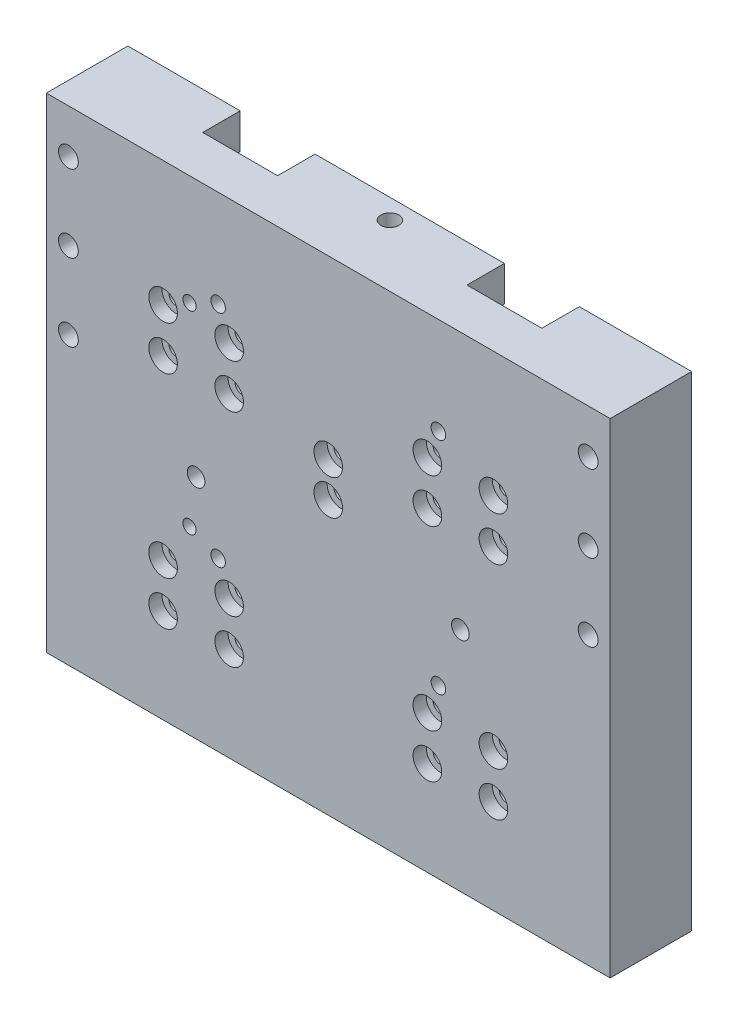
ISO-10303-21;
HEADER;
FILE_DESCRIPTION(('STEP AP214'),'2;1');
FILE_NAME('part.step','',(''),(''),'','','');
FILE_SCHEMA(('AUTOMOTIVE_DESIGN { 1 0 10303 214 1 1 1 1 }'));
ENDSEC;
DATA;
#1=APPLICATION_CONTEXT('core data for automotive mechanical design processes');
#2=APPLICATION_PROTOCOL_DEFINITION('international standard','automotive_design',2000,#1);
#3=PRODUCT_CONTEXT('',#1,'mechanical');
#4=PRODUCT('Part','Part','',(#3));
#5=PRODUCT_RELATED_PRODUCT_CATEGORY('part','',(#4));
#6=PRODUCT_DEFINITION_FORMATION('','',#4);
#7=PRODUCT_DEFINITION_CONTEXT('part definition',#1,'design');
#8=PRODUCT_DEFINITION('design','',#6,#7);
#9=PRODUCT_DEFINITION_SHAPE('','',#8);
#10=(LENGTH_UNIT() NAMED_UNIT(*) SI_UNIT(.MILLI.,.METRE.));
#11=(NAMED_UNIT(*) PLANE_ANGLE_UNIT() SI_UNIT($,.RADIAN.));
#12=(NAMED_UNIT(*) SI_UNIT($,.STERADIAN.) SOLID_ANGLE_UNIT());
#13=UNCERTAINTY_MEASURE_WITH_UNIT(LENGTH_MEASURE(1.E-05),#10,'distance_accuracy_value','');
#14=(GEOMETRIC_REPRESENTATION_CONTEXT(3) GLOBAL_UNCERTAINTY_ASSIGNED_CONTEXT((#13)) GLOBAL_UNIT_ASSIGNED_CONTEXT((#10,
#11,#12)) REPRESENTATION_CONTEXT('',''));
#15=CARTESIAN_POINT('',(0.,0.,0.));
#16=DIRECTION('',(0.,0.,1.));
#17=DIRECTION('',(1.,0.,0.));
#18=AXIS2_PLACEMENT_3D('',#15,#16,#17);
#19=CARTESIAN_POINT('',(-64.,55.,18.5));
#20=DIRECTION('',(0.,-1.,0.));
#21=DIRECTION('',(0.,0.,-1.));
#22=AXIS2_PLACEMENT_3D('',#19,#20,#21);
#23=PLANE('',#22);
#24=DIRECTION('',(1.,0.,0.));
#25=VECTOR('',#24,1.);
#26=CARTESIAN_POINT('',(21.5,55.,8.5));
#27=LINE('',#26,#25);
#28=CARTESIAN_POINT('',(21.5,55.,8.5));
#29=VERTEX_POINT('',#28);
#30=CARTESIAN_POINT('',(38.5,55.,8.5));
#31=VERTEX_POINT('',#30);
#32=EDGE_CURVE('E253',#29,#31,#27,.T.);
#33=ORIENTED_EDGE('',*,*,#32,.F.);
#34=DIRECTION('',(0.,0.,1.));
#35=VECTOR('',#34,1.);
#36=CARTESIAN_POINT('',(21.5,55.,0.));
#37=LINE('',#36,#35);
#38=CARTESIAN_POINT('',(21.5,55.,0.));
#39=VERTEX_POINT('',#38);
#40=EDGE_CURVE('E260',#39,#29,#37,.T.);
#41=ORIENTED_EDGE('',*,*,#40,.F.);
#42=DIRECTION('',(-1.,0.,0.));
#43=VECTOR('',#42,1.);
#44=CARTESIAN_POINT('',(-64.,55.,0.));
#45=LINE('',#44,#43);
#46=CARTESIAN_POINT('',(-21.5,55.,0.));
#47=VERTEX_POINT('',#46);
#48=EDGE_CURVE('E366',#39,#47,#45,.T.);
#49=ORIENTED_EDGE('',*,*,#48,.T.);
#50=DIRECTION('',(0.,0.,-1.));
#51=VECTOR('',#50,1.);
#52=CARTESIAN_POINT('',(-21.5,55.,0.));
#53=LINE('',#52,#51);
#54=CARTESIAN_POINT('',(-21.5,55.,8.5));
#55=VERTEX_POINT('',#54);
#56=EDGE_CURVE('E287',#55,#47,#53,.T.);
#57=ORIENTED_EDGE('',*,*,#56,.F.);
#58=DIRECTION('',(1.,0.,0.));
#59=VECTOR('',#58,1.);
#60=CARTESIAN_POINT('',(-38.5,55.,8.5));
#61=LINE('',#60,#59);
#62=CARTESIAN_POINT('',(-38.5,55.,8.5));
#63=VERTEX_POINT('',#62);
#64=EDGE_CURVE('E295',#63,#55,#61,.T.);
#65=ORIENTED_EDGE('',*,*,#64,.F.);
#66=DIRECTION('',(0.,0.,1.));
#67=VECTOR('',#66,1.);
#68=CARTESIAN_POINT('',(-38.5,55.,0.));
#69=LINE('',#68,#67);
#70=CARTESIAN_POINT('',(-38.5,55.,0.));
#71=VERTEX_POINT('',#70);
#72=EDGE_CURVE('E282',#71,#63,#69,.T.);
#73=ORIENTED_EDGE('',*,*,#72,.F.);
#74=CARTESIAN_POINT('',(-64.,55.,0.));
#75=VERTEX_POINT('',#74);
#76=EDGE_CURVE('E361',#71,#75,#45,.T.);
#77=ORIENTED_EDGE('',*,*,#76,.T.);
#78=DIRECTION('',(0.,0.,-1.));
#79=VECTOR('',#78,1.);
#80=CARTESIAN_POINT('',(-64.,55.,18.5));
#81=LINE('',#80,#79);
#82=CARTESIAN_POINT('',(-64.,55.,18.5));
#83=VERTEX_POINT('',#82);
#84=EDGE_CURVE('E376',#83,#75,#81,.T.);
#85=ORIENTED_EDGE('',*,*,#84,.F.);
#86=DIRECTION('',(-1.,0.,0.));
#87=VECTOR('',#86,1.);
#88=CARTESIAN_POINT('',(-64.,55.,18.5));
#89=LINE('',#88,#87);
#90=CARTESIAN_POINT('',(64.,55.,18.5));
#91=VERTEX_POINT('',#90);
#92=EDGE_CURVE('E351',#91,#83,#89,.T.);
#93=ORIENTED_EDGE('',*,*,#92,.F.);
#94=DIRECTION('',(0.,0.,-1.));
#95=VECTOR('',#94,1.);
#96=CARTESIAN_POINT('',(64.,55.,18.5));
#97=LINE('',#96,#95);
#98=CARTESIAN_POINT('',(64.,55.,0.));
#99=VERTEX_POINT('',#98);
#100=EDGE_CURVE('E379',#91,#99,#97,.T.);
#101=ORIENTED_EDGE('',*,*,#100,.T.);
#102=CARTESIAN_POINT('',(38.5,55.,0.));
#103=VERTEX_POINT('',#102);
#104=EDGE_CURVE('E362',#99,#103,#45,.T.);
#105=ORIENTED_EDGE('',*,*,#104,.T.);
#106=DIRECTION('',(0.,0.,-1.));
#107=VECTOR('',#106,1.);
#108=CARTESIAN_POINT('',(38.5,55.,0.));
#109=LINE('',#108,#107);
#110=EDGE_CURVE('E251',#31,#103,#109,.T.);
#111=ORIENTED_EDGE('',*,*,#110,.F.);
#112=EDGE_LOOP('',(#33,#41,#49,#57,#65,#73,#77,#85,#93,#101,#105,#111));
#113=FACE_BOUND('',#112,.T.);
#114=CARTESIAN_POINT('',(0.,55.,4.5));
#115=DIRECTION('',(0.,1.,0.));
#116=DIRECTION('',(0.,0.,1.));
#117=AXIS2_PLACEMENT_3D('',#114,#115,#116);
#118=CIRCLE('',#117,2.04999999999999);
#119=CARTESIAN_POINT('',(0.,55.,6.54999999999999));
#120=VERTEX_POINT('',#119);
#121=EDGE_CURVE('E525',#120,#120,#118,.T.);
#122=ORIENTED_EDGE('',*,*,#121,.F.);
#123=EDGE_LOOP('',(#122));
#124=FACE_BOUND('',#123,.T.);
#125=ADVANCED_FACE('F38',(#113,#124),#23,.F.);
#126=CARTESIAN_POINT('',(0.,0.,0.));
#127=DIRECTION('',(0.,0.,-1.));
#128=DIRECTION('',(-1.,0.,0.));
#129=AXIS2_PLACEMENT_3D('',#126,#127,#128);
#130=PLANE('',#129);
#131=DIRECTION('',(0.,1.,0.));
#132=VECTOR('',#131,1.);
#133=CARTESIAN_POINT('',(21.5,-55.,0.));
#134=LINE('',#133,#132);
#135=CARTESIAN_POINT('',(21.5,47.,0.));
#136=VERTEX_POINT('',#135);
#137=EDGE_CURVE('E268',#136,#39,#134,.T.);
#138=ORIENTED_EDGE('',*,*,#137,.F.);
#139=DIRECTION('',(1.,0.,0.));
#140=VECTOR('',#139,1.);
#141=CARTESIAN_POINT('',(49.,47.,0.));
#142=LINE('',#141,#140);
#143=CARTESIAN_POINT('',(-21.5,47.,0.));
#144=VERTEX_POINT('',#143);
#145=EDGE_CURVE('E347',#144,#136,#142,.T.);
#146=ORIENTED_EDGE('',*,*,#145,.F.);
#147=DIRECTION('',(0.,1.,0.));
#148=VECTOR('',#147,1.);
#149=CARTESIAN_POINT('',(-21.5,-55.,0.));
#150=LINE('',#149,#148);
#151=EDGE_CURVE('E307',#144,#47,#150,.T.);
#152=ORIENTED_EDGE('',*,*,#151,.T.);
#153=ORIENTED_EDGE('',*,*,#48,.F.);
#154=EDGE_LOOP('',(#138,#146,#152,#153));
#155=FACE_BOUND('',#154,.T.);
#156=ADVANCED_FACE('F780',(#155),#130,.T.);
#157=CARTESIAN_POINT('',(21.5,-55.,0.));
#158=VERTEX_POINT('',#157);
#159=CARTESIAN_POINT('',(21.5,-52.,0.));
#160=VERTEX_POINT('',#159);
#161=EDGE_CURVE('E265',#158,#160,#134,.T.);
#162=ORIENTED_EDGE('',*,*,#161,.F.);
#163=DIRECTION('',(1.,0.,0.));
#164=VECTOR('',#163,1.);
#165=CARTESIAN_POINT('',(-64.,-55.,0.));
#166=LINE('',#165,#164);
#167=CARTESIAN_POINT('',(-21.5,-55.,0.));
#168=VERTEX_POINT('',#167);
#169=EDGE_CURVE('E250',#168,#158,#166,.T.);
#170=ORIENTED_EDGE('',*,*,#169,.F.);
#171=CARTESIAN_POINT('',(-21.5,-52.,0.));
#172=VERTEX_POINT('',#171);
#173=EDGE_CURVE('E304',#168,#172,#150,.T.);
#174=ORIENTED_EDGE('',*,*,#173,.T.);
#175=DIRECTION('',(-1.,0.,0.));
#176=VECTOR('',#175,1.);
#177=CARTESIAN_POINT('',(49.,-52.,0.));
#178=LINE('',#177,#176);
#179=EDGE_CURVE('E342',#160,#172,#178,.T.);
#180=ORIENTED_EDGE('',*,*,#179,.F.);
#181=EDGE_LOOP('',(#162,#170,#174,#180));
#182=FACE_BOUND('',#181,.T.);
#183=ADVANCED_FACE('F786',(#182),#130,.T.);
#184=CARTESIAN_POINT('',(-59.,45.,0.));
#185=DIRECTION('',(0.,0.,-1.));
#186=DIRECTION('',(-1.,0.,0.));
#187=AXIS2_PLACEMENT_3D('',#184,#185,#186);
#188=CIRCLE('',#187,4.);
#189=CARTESIAN_POINT('',(-63.,45.,0.));
#190=VERTEX_POINT('',#189);
#191=EDGE_CURVE('E688',#190,#190,#188,.T.);
#192=ORIENTED_EDGE('',*,*,#191,.F.);
#193=EDGE_LOOP('',(#192));
#194=FACE_BOUND('',#193,.T.);
#195=CARTESIAN_POINT('',(-59.,27.5,0.));
#196=DIRECTION('',(0.,0.,-1.));
#197=DIRECTION('',(-1.,0.,0.));
#198=AXIS2_PLACEMENT_3D('',#195,#196,#197);
#199=CIRCLE('',#198,4.);
#200=CARTESIAN_POINT('',(-63.,27.5,0.));
#201=VERTEX_POINT('',#200);
#202=EDGE_CURVE('E700',#201,#201,#199,.T.);
#203=ORIENTED_EDGE('',*,*,#202,.F.);
#204=EDGE_LOOP('',(#203));
#205=FACE_BOUND('',#204,.T.);
#206=CARTESIAN_POINT('',(-59.,10.,0.));
#207=DIRECTION('',(0.,0.,-1.));
#208=DIRECTION('',(-1.,0.,0.));
#209=AXIS2_PLACEMENT_3D('',#206,#207,#208);
#210=CIRCLE('',#209,4.);
#211=CARTESIAN_POINT('',(-63.,10.,0.));
#212=VERTEX_POINT('',#211);
#213=EDGE_CURVE('E712',#212,#212,#210,.T.);
#214=ORIENTED_EDGE('',*,*,#213,.F.);
#215=EDGE_LOOP('',(#214));
#216=FACE_BOUND('',#215,.T.);
#217=DIRECTION('',(0.,1.,0.));
#218=VECTOR('',#217,1.);
#219=CARTESIAN_POINT('',(-38.5,-55.,0.));
#220=LINE('',#219,#218);
#221=CARTESIAN_POINT('',(-38.5,-55.,0.));
#222=VERTEX_POINT('',#221);
#223=CARTESIAN_POINT('',(-38.5,-52.,0.));
#224=VERTEX_POINT('',#223);
#225=EDGE_CURVE('E300',#222,#224,#220,.T.);
#226=ORIENTED_EDGE('',*,*,#225,.F.);
#227=CARTESIAN_POINT('',(-64.,-55.,0.));
#228=VERTEX_POINT('',#227);
#229=EDGE_CURVE('E352',#228,#222,#166,.T.);
#230=ORIENTED_EDGE('',*,*,#229,.F.);
#231=DIRECTION('',(0.,-1.,0.));
#232=VECTOR('',#231,1.);
#233=CARTESIAN_POINT('',(-64.,-55.,0.));
#234=LINE('',#233,#232);
#235=EDGE_CURVE('E365',#75,#228,#234,.T.);
#236=ORIENTED_EDGE('',*,*,#235,.F.);
#237=ORIENTED_EDGE('',*,*,#76,.F.);
#238=CARTESIAN_POINT('',(-38.5,47.,0.));
#239=VERTEX_POINT('',#238);
#240=EDGE_CURVE('E303',#239,#71,#220,.T.);
#241=ORIENTED_EDGE('',*,*,#240,.F.);
#242=CARTESIAN_POINT('',(-45.,47.,0.));
#243=VERTEX_POINT('',#242);
#244=EDGE_CURVE('E327',#243,#239,#142,.T.);
#245=ORIENTED_EDGE('',*,*,#244,.F.);
#246=CARTESIAN_POINT('',(-45.,43.,0.));
#247=DIRECTION('',(0.,0.,-1.));
#248=DIRECTION('',(-1.,0.,0.));
#249=AXIS2_PLACEMENT_3D('',#246,#247,#248);
#250=CIRCLE('',#249,4.);
#251=CARTESIAN_POINT('',(-49.,43.,0.));
#252=VERTEX_POINT('',#251);
#253=EDGE_CURVE('E426',#243,#252,#250,.F.);
#254=ORIENTED_EDGE('',*,*,#253,.T.);
#255=DIRECTION('',(0.,1.,0.));
#256=VECTOR('',#255,1.);
#257=CARTESIAN_POINT('',(-49.,-52.,0.));
#258=LINE('',#257,#256);
#259=CARTESIAN_POINT('',(-49.,-48.,0.));
#260=VERTEX_POINT('',#259);
#261=EDGE_CURVE('E341',#260,#252,#258,.T.);
#262=ORIENTED_EDGE('',*,*,#261,.F.);
#263=CARTESIAN_POINT('',(-45.,-48.,0.));
#264=DIRECTION('',(0.,0.,-1.));
#265=DIRECTION('',(-1.,0.,0.));
#266=AXIS2_PLACEMENT_3D('',#263,#264,#265);
#267=CIRCLE('',#266,4.);
#268=CARTESIAN_POINT('',(-45.,-52.,0.));
#269=VERTEX_POINT('',#268);
#270=EDGE_CURVE('E424',#260,#269,#267,.F.);
#271=ORIENTED_EDGE('',*,*,#270,.T.);
#272=EDGE_CURVE('E338',#224,#269,#178,.T.);
#273=ORIENTED_EDGE('',*,*,#272,.F.);
#274=EDGE_LOOP('',(#226,#230,#236,#237,#241,#245,#254,#262,#271,#273));
#275=FACE_BOUND('',#274,.T.);
#276=ADVANCED_FACE('F799',(#194,#205,#216,#275),#130,.T.);
#277=CARTESIAN_POINT('',(64.,-55.,18.5));
#278=DIRECTION('',(-1.,0.,0.));
#279=DIRECTION('',(0.,0.,1.));
#280=AXIS2_PLACEMENT_3D('',#277,#278,#279);
#281=PLANE('',#280);
#282=DIRECTION('',(0.,1.,0.));
#283=VECTOR('',#282,1.);
#284=CARTESIAN_POINT('',(64.,-55.,0.));
#285=LINE('',#284,#283);
#286=CARTESIAN_POINT('',(64.,-55.,0.));
#287=VERTEX_POINT('',#286);
#288=EDGE_CURVE('E336',#287,#99,#285,.T.);
#289=ORIENTED_EDGE('',*,*,#288,.T.);
#290=ORIENTED_EDGE('',*,*,#100,.F.);
#291=DIRECTION('',(0.,1.,0.));
#292=VECTOR('',#291,1.);
#293=CARTESIAN_POINT('',(64.,-55.,18.5));
#294=LINE('',#293,#292);
#295=CARTESIAN_POINT('',(64.,-55.,18.5));
#296=VERTEX_POINT('',#295);
#297=EDGE_CURVE('E348',#296,#91,#294,.T.);
#298=ORIENTED_EDGE('',*,*,#297,.F.);
#299=DIRECTION('',(0.,0.,-1.));
#300=VECTOR('',#299,1.);
#301=CARTESIAN_POINT('',(64.,-55.,18.5));
#302=LINE('',#301,#300);
#303=EDGE_CURVE('E358',#296,#287,#302,.T.);
#304=ORIENTED_EDGE('',*,*,#303,.T.);
#305=EDGE_LOOP('',(#289,#290,#298,#304));
#306=FACE_BOUND('',#305,.T.);
#307=ADVANCED_FACE('F796',(#306),#281,.F.);
#308=CARTESIAN_POINT('',(-64.,-55.,18.5));
#309=DIRECTION('',(1.,0.,0.));
#310=DIRECTION('',(0.,0.,-1.));
#311=AXIS2_PLACEMENT_3D('',#308,#309,#310);
#312=PLANE('',#311);
#313=ORIENTED_EDGE('',*,*,#235,.T.);
#314=DIRECTION('',(0.,0.,-1.));
#315=VECTOR('',#314,1.);
#316=CARTESIAN_POINT('',(-64.,-55.,18.5));
#317=LINE('',#316,#315);
#318=CARTESIAN_POINT('',(-64.,-55.,18.5));
#319=VERTEX_POINT('',#318);
#320=EDGE_CURVE('E373',#319,#228,#317,.T.);
#321=ORIENTED_EDGE('',*,*,#320,.F.);
#322=DIRECTION('',(0.,-1.,0.));
#323=VECTOR('',#322,1.);
#324=CARTESIAN_POINT('',(-64.,-55.,18.5));
#325=LINE('',#324,#323);
#326=EDGE_CURVE('E354',#83,#319,#325,.T.);
#327=ORIENTED_EDGE('',*,*,#326,.F.);
#328=ORIENTED_EDGE('',*,*,#84,.T.);
#329=EDGE_LOOP('',(#313,#321,#327,#328));
#330=FACE_BOUND('',#329,.T.);
#331=ADVANCED_FACE('F794',(#330),#312,.F.);
#332=CARTESIAN_POINT('',(-64.,-55.,18.5));
#333=DIRECTION('',(0.,1.,0.));
#334=DIRECTION('',(0.,0.,1.));
#335=AXIS2_PLACEMENT_3D('',#332,#333,#334);
#336=PLANE('',#335);
#337=ORIENTED_EDGE('',*,*,#169,.T.);
#338=DIRECTION('',(0.,0.,1.));
#339=VECTOR('',#338,1.);
#340=CARTESIAN_POINT('',(21.5,-55.,0.));
#341=LINE('',#340,#339);
#342=CARTESIAN_POINT('',(21.5,-55.,8.5));
#343=VERTEX_POINT('',#342);
#344=EDGE_CURVE('E227',#158,#343,#341,.T.);
#345=ORIENTED_EDGE('',*,*,#344,.T.);
#346=DIRECTION('',(1.,0.,0.));
#347=VECTOR('',#346,1.);
#348=CARTESIAN_POINT('',(21.5,-55.,8.5));
#349=LINE('',#348,#347);
#350=CARTESIAN_POINT('',(38.5,-55.,8.5));
#351=VERTEX_POINT('',#350);
#352=EDGE_CURVE('E237',#343,#351,#349,.T.);
#353=ORIENTED_EDGE('',*,*,#352,.T.);
#354=DIRECTION('',(0.,0.,-1.));
#355=VECTOR('',#354,1.);
#356=CARTESIAN_POINT('',(38.5,-55.,0.));
#357=LINE('',#356,#355);
#358=CARTESIAN_POINT('',(38.5,-55.,0.));
#359=VERTEX_POINT('',#358);
#360=EDGE_CURVE('E244',#351,#359,#357,.T.);
#361=ORIENTED_EDGE('',*,*,#360,.T.);
#362=EDGE_CURVE('E368',#359,#287,#166,.T.);
#363=ORIENTED_EDGE('',*,*,#362,.T.);
#364=ORIENTED_EDGE('',*,*,#303,.F.);
#365=DIRECTION('',(1.,0.,0.));
#366=VECTOR('',#365,1.);
#367=CARTESIAN_POINT('',(-64.,-55.,18.5));
#368=LINE('',#367,#366);
#369=EDGE_CURVE('E356',#319,#296,#368,.T.);
#370=ORIENTED_EDGE('',*,*,#369,.F.);
#371=ORIENTED_EDGE('',*,*,#320,.T.);
#372=ORIENTED_EDGE('',*,*,#229,.T.);
#373=DIRECTION('',(0.,0.,1.));
#374=VECTOR('',#373,1.);
#375=CARTESIAN_POINT('',(-38.5,-55.,0.));
#376=LINE('',#375,#374);
#377=CARTESIAN_POINT('',(-38.5,-55.,8.5));
#378=VERTEX_POINT('',#377);
#379=EDGE_CURVE('E283',#222,#378,#376,.T.);
#380=ORIENTED_EDGE('',*,*,#379,.T.);
#381=DIRECTION('',(1.,0.,0.));
#382=VECTOR('',#381,1.);
#383=CARTESIAN_POINT('',(-38.5,-55.,8.5));
#384=LINE('',#383,#382);
#385=CARTESIAN_POINT('',(-21.5,-55.,8.5));
#386=VERTEX_POINT('',#385);
#387=EDGE_CURVE('E286',#378,#386,#384,.T.);
#388=ORIENTED_EDGE('',*,*,#387,.T.);
#389=DIRECTION('',(0.,0.,-1.));
#390=VECTOR('',#389,1.);
#391=CARTESIAN_POINT('',(-21.5,-55.,0.));
#392=LINE('',#391,#390);
#393=EDGE_CURVE('E290',#386,#168,#392,.T.);
#394=ORIENTED_EDGE('',*,*,#393,.T.);
#395=EDGE_LOOP('',(#337,#345,#353,#361,#363,#364,#370,#371,#372,#380,#388,#394));
#396=FACE_BOUND('',#395,.T.);
#397=ADVANCED_FACE('F247',(#396),#336,.F.);
#398=CARTESIAN_POINT('',(0.,0.,18.5));
#399=DIRECTION('',(0.,0.,-1.));
#400=DIRECTION('',(-1.,0.,0.));
#401=AXIS2_PLACEMENT_3D('',#398,#399,#400);
#402=PLANE('',#401);
#403=CARTESIAN_POINT('',(-30.,-3.49999999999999,18.5));
#404=DIRECTION('',(0.,0.,1.));
#405=DIRECTION('',(1.,0.,0.));
#406=AXIS2_PLACEMENT_3D('',#403,#404,#405);
#407=CIRCLE('',#406,1.99999999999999);
#408=CARTESIAN_POINT('',(-28.,-3.49999999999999,18.5));
#409=VERTEX_POINT('',#408);
#410=EDGE_CURVE('E1905',#409,#409,#407,.T.);
#411=ORIENTED_EDGE('',*,*,#410,.F.);
#412=EDGE_LOOP('',(#411));
#413=FACE_BOUND('',#412,.T.);
#414=CARTESIAN_POINT('',(30.,-3.49999999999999,18.5));
#415=DIRECTION('',(0.,0.,1.));
#416=DIRECTION('',(1.,0.,0.));
#417=AXIS2_PLACEMENT_3D('',#414,#415,#416);
#418=CIRCLE('',#417,1.99999999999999);
#419=CARTESIAN_POINT('',(32.,-3.49999999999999,18.5));
#420=VERTEX_POINT('',#419);
#421=EDGE_CURVE('E1909',#420,#420,#418,.T.);
#422=ORIENTED_EDGE('',*,*,#421,.F.);
#423=EDGE_LOOP('',(#422));
#424=FACE_BOUND('',#423,.T.);
#425=CARTESIAN_POINT('',(-31.5,30.,18.5));
#426=DIRECTION('',(0.,0.,1.));
#427=DIRECTION('',(1.,0.,0.));
#428=AXIS2_PLACEMENT_3D('',#425,#426,#427);
#429=CIRCLE('',#428,1.49999999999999);
#430=CARTESIAN_POINT('',(-30.,30.,18.5));
#431=VERTEX_POINT('',#430);
#432=EDGE_CURVE('E537',#431,#431,#429,.T.);
#433=ORIENTED_EDGE('',*,*,#432,.F.);
#434=EDGE_LOOP('',(#433));
#435=FACE_BOUND('',#434,.T.);
#436=CARTESIAN_POINT('',(-31.5,-14.,18.5));
#437=DIRECTION('',(0.,0.,1.));
#438=DIRECTION('',(1.,0.,0.));
#439=AXIS2_PLACEMENT_3D('',#436,#437,#438);
#440=CIRCLE('',#439,1.49999999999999);
#441=CARTESIAN_POINT('',(-30.,-14.,18.5));
#442=VERTEX_POINT('',#441);
#443=EDGE_CURVE('E526',#442,#442,#440,.T.);
#444=ORIENTED_EDGE('',*,*,#443,.F.);
#445=EDGE_LOOP('',(#444));
#446=FACE_BOUND('',#445,.T.);
#447=CARTESIAN_POINT('',(-37.5,26.6,18.5));
#448=DIRECTION('',(0.,0.,1.));
#449=DIRECTION('',(1.,0.,0.));
#450=AXIS2_PLACEMENT_3D('',#447,#448,#449);
#451=CIRCLE('',#450,3.25);
#452=CARTESIAN_POINT('',(-34.25,26.6,18.5));
#453=VERTEX_POINT('',#452);
#454=EDGE_CURVE('E543',#453,#453,#451,.T.);
#455=ORIENTED_EDGE('',*,*,#454,.F.);
#456=EDGE_LOOP('',(#455));
#457=FACE_BOUND('',#456,.T.);
#458=CARTESIAN_POINT('',(-37.5,16.6,18.5));
#459=DIRECTION('',(0.,0.,1.));
#460=DIRECTION('',(1.,0.,0.));
#461=AXIS2_PLACEMENT_3D('',#458,#459,#460);
#462=CIRCLE('',#461,3.25);
#463=CARTESIAN_POINT('',(-34.25,16.6,18.5));
#464=VERTEX_POINT('',#463);
#465=EDGE_CURVE('E521',#464,#464,#462,.T.);
#466=ORIENTED_EDGE('',*,*,#465,.F.);
#467=EDGE_LOOP('',(#466));
#468=FACE_BOUND('',#467,.T.);
#469=CARTESIAN_POINT('',(-22.5,26.6,18.5));
#470=DIRECTION('',(0.,0.,1.));
#471=DIRECTION('',(1.,0.,0.));
#472=AXIS2_PLACEMENT_3D('',#469,#470,#471);
#473=CIRCLE('',#472,3.25);
#474=CARTESIAN_POINT('',(-19.25,26.6,18.5));
#475=VERTEX_POINT('',#474);
#476=EDGE_CURVE('E517',#475,#475,#473,.T.);
#477=ORIENTED_EDGE('',*,*,#476,.F.);
#478=EDGE_LOOP('',(#477));
#479=FACE_BOUND('',#478,.T.);
#480=CARTESIAN_POINT('',(-22.5,16.6,18.5));
#481=DIRECTION('',(0.,0.,1.));
#482=DIRECTION('',(1.,0.,0.));
#483=AXIS2_PLACEMENT_3D('',#480,#481,#482);
#484=CIRCLE('',#483,3.25);
#485=CARTESIAN_POINT('',(-19.25,16.6,18.5));
#486=VERTEX_POINT('',#485);
#487=EDGE_CURVE('E512',#486,#486,#484,.T.);
#488=ORIENTED_EDGE('',*,*,#487,.F.);
#489=EDGE_LOOP('',(#488));
#490=FACE_BOUND('',#489,.T.);
#491=CARTESIAN_POINT('',(-37.5,-23.6,18.5));
#492=DIRECTION('',(0.,0.,1.));
#493=DIRECTION('',(1.,0.,0.));
#494=AXIS2_PLACEMENT_3D('',#491,#492,#493);
#495=CIRCLE('',#494,3.25);
#496=CARTESIAN_POINT('',(-34.25,-23.6,18.5));
#497=VERTEX_POINT('',#496);
#498=EDGE_CURVE('E507',#497,#497,#495,.T.);
#499=ORIENTED_EDGE('',*,*,#498,.F.);
#500=EDGE_LOOP('',(#499));
#501=FACE_BOUND('',#500,.T.);
#502=CARTESIAN_POINT('',(-37.5,-33.6,18.5));
#503=DIRECTION('',(0.,0.,1.));
#504=DIRECTION('',(1.,0.,0.));
#505=AXIS2_PLACEMENT_3D('',#502,#503,#504);
#506=CIRCLE('',#505,3.25);
#507=CARTESIAN_POINT('',(-34.25,-33.6,18.5));
#508=VERTEX_POINT('',#507);
#509=EDGE_CURVE('E502',#508,#508,#506,.T.);
#510=ORIENTED_EDGE('',*,*,#509,.F.);
#511=EDGE_LOOP('',(#510));
#512=FACE_BOUND('',#511,.T.);
#513=CARTESIAN_POINT('',(-22.5,-33.6,18.5));
#514=DIRECTION('',(0.,0.,1.));
#515=DIRECTION('',(1.,0.,0.));
#516=AXIS2_PLACEMENT_3D('',#513,#514,#515);
#517=CIRCLE('',#516,3.25);
#518=CARTESIAN_POINT('',(-19.25,-33.6,18.5));
#519=VERTEX_POINT('',#518);
#520=EDGE_CURVE('E497',#519,#519,#517,.T.);
#521=ORIENTED_EDGE('',*,*,#520,.F.);
#522=EDGE_LOOP('',(#521));
#523=FACE_BOUND('',#522,.T.);
#524=CARTESIAN_POINT('',(-22.5,-23.6,18.5));
#525=DIRECTION('',(0.,0.,1.));
#526=DIRECTION('',(1.,0.,0.));
#527=AXIS2_PLACEMENT_3D('',#524,#525,#526);
#528=CIRCLE('',#527,3.25);
#529=CARTESIAN_POINT('',(-19.25,-23.6,18.5));
#530=VERTEX_POINT('',#529);
#531=EDGE_CURVE('E492',#530,#530,#528,.T.);
#532=ORIENTED_EDGE('',*,*,#531,.F.);
#533=EDGE_LOOP('',(#532));
#534=FACE_BOUND('',#533,.T.);
#535=CARTESIAN_POINT('',(22.5,-23.6,18.5));
#536=DIRECTION('',(0.,0.,1.));
#537=DIRECTION('',(1.,0.,0.));
#538=AXIS2_PLACEMENT_3D('',#535,#536,#537);
#539=CIRCLE('',#538,3.25);
#540=CARTESIAN_POINT('',(25.75,-23.6,18.5));
#541=VERTEX_POINT('',#540);
#542=EDGE_CURVE('E487',#541,#541,#539,.T.);
#543=ORIENTED_EDGE('',*,*,#542,.F.);
#544=EDGE_LOOP('',(#543));
#545=FACE_BOUND('',#544,.T.);
#546=CARTESIAN_POINT('',(22.5,-33.6,18.5));
#547=DIRECTION('',(0.,0.,1.));
#548=DIRECTION('',(1.,0.,0.));
#549=AXIS2_PLACEMENT_3D('',#546,#547,#548);
#550=CIRCLE('',#549,3.25);
#551=CARTESIAN_POINT('',(25.75,-33.6,18.5));
#552=VERTEX_POINT('',#551);
#553=EDGE_CURVE('E482',#552,#552,#550,.T.);
#554=ORIENTED_EDGE('',*,*,#553,.F.);
#555=EDGE_LOOP('',(#554));
#556=FACE_BOUND('',#555,.T.);
#557=CARTESIAN_POINT('',(37.5,-33.6,18.5));
#558=DIRECTION('',(0.,0.,1.));
#559=DIRECTION('',(1.,0.,0.));
#560=AXIS2_PLACEMENT_3D('',#557,#558,#559);
#561=CIRCLE('',#560,3.25);
#562=CARTESIAN_POINT('',(40.75,-33.6,18.5));
#563=VERTEX_POINT('',#562);
#564=EDGE_CURVE('E477',#563,#563,#561,.T.);
#565=ORIENTED_EDGE('',*,*,#564,.F.);
#566=EDGE_LOOP('',(#565));
#567=FACE_BOUND('',#566,.T.);
#568=CARTESIAN_POINT('',(37.5,-23.6,18.5));
#569=DIRECTION('',(0.,0.,1.));
#570=DIRECTION('',(1.,0.,0.));
#571=AXIS2_PLACEMENT_3D('',#568,#569,#570);
#572=CIRCLE('',#571,3.25);
#573=CARTESIAN_POINT('',(40.75,-23.6,18.5));
#574=VERTEX_POINT('',#573);
#575=EDGE_CURVE('E472',#574,#574,#572,.T.);
#576=ORIENTED_EDGE('',*,*,#575,.F.);
#577=EDGE_LOOP('',(#576));
#578=FACE_BOUND('',#577,.T.);
#579=CARTESIAN_POINT('',(37.5,16.6,18.5));
#580=DIRECTION('',(0.,0.,1.));
#581=DIRECTION('',(1.,0.,0.));
#582=AXIS2_PLACEMENT_3D('',#579,#580,#581);
#583=CIRCLE('',#582,3.25);
#584=CARTESIAN_POINT('',(40.75,16.6,18.5));
#585=VERTEX_POINT('',#584);
#586=EDGE_CURVE('E467',#585,#585,#583,.T.);
#587=ORIENTED_EDGE('',*,*,#586,.F.);
#588=EDGE_LOOP('',(#587));
#589=FACE_BOUND('',#588,.T.);
#590=CARTESIAN_POINT('',(37.5,26.6,18.5));
#591=DIRECTION('',(0.,0.,1.));
#592=DIRECTION('',(1.,0.,0.));
#593=AXIS2_PLACEMENT_3D('',#590,#591,#592);
#594=CIRCLE('',#593,3.25);
#595=CARTESIAN_POINT('',(40.75,26.6,18.5));
#596=VERTEX_POINT('',#595);
#597=EDGE_CURVE('E462',#596,#596,#594,.T.);
#598=ORIENTED_EDGE('',*,*,#597,.F.);
#599=EDGE_LOOP('',(#598));
#600=FACE_BOUND('',#599,.T.);
#601=CARTESIAN_POINT('',(22.5,26.6,18.5));
#602=DIRECTION('',(0.,0.,1.));
#603=DIRECTION('',(1.,0.,0.));
#604=AXIS2_PLACEMENT_3D('',#601,#602,#603);
#605=CIRCLE('',#604,3.25);
#606=CARTESIAN_POINT('',(25.75,26.6,18.5));
#607=VERTEX_POINT('',#606);
#608=EDGE_CURVE('E457',#607,#607,#605,.T.);
#609=ORIENTED_EDGE('',*,*,#608,.F.);
#610=EDGE_LOOP('',(#609));
#611=FACE_BOUND('',#610,.T.);
#612=CARTESIAN_POINT('',(22.5,16.6,18.5));
#613=DIRECTION('',(0.,0.,1.));
#614=DIRECTION('',(1.,0.,0.));
#615=AXIS2_PLACEMENT_3D('',#612,#613,#614);
#616=CIRCLE('',#615,3.25);
#617=CARTESIAN_POINT('',(25.75,16.6,18.5));
#618=VERTEX_POINT('',#617);
#619=EDGE_CURVE('E452',#618,#618,#616,.T.);
#620=ORIENTED_EDGE('',*,*,#619,.F.);
#621=EDGE_LOOP('',(#620));
#622=FACE_BOUND('',#621,.T.);
#623=CARTESIAN_POINT('',(0.,15.,18.5));
#624=DIRECTION('',(0.,0.,1.));
#625=DIRECTION('',(1.,0.,0.));
#626=AXIS2_PLACEMENT_3D('',#623,#624,#625);
#627=CIRCLE('',#626,3.25);
#628=CARTESIAN_POINT('',(3.24999999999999,15.,18.5));
#629=VERTEX_POINT('',#628);
#630=EDGE_CURVE('E447',#629,#629,#627,.T.);
#631=ORIENTED_EDGE('',*,*,#630,.F.);
#632=EDGE_LOOP('',(#631));
#633=FACE_BOUND('',#632,.T.);
#634=CARTESIAN_POINT('',(0.,7.00000000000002,18.5));
#635=DIRECTION('',(0.,0.,1.));
#636=DIRECTION('',(1.,0.,0.));
#637=AXIS2_PLACEMENT_3D('',#634,#635,#636);
#638=CIRCLE('',#637,3.25);
#639=CARTESIAN_POINT('',(3.24999999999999,7.00000000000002,18.5));
#640=VERTEX_POINT('',#639);
#641=EDGE_CURVE('E442',#640,#640,#638,.T.);
#642=ORIENTED_EDGE('',*,*,#641,.F.);
#643=EDGE_LOOP('',(#642));
#644=FACE_BOUND('',#643,.T.);
#645=CARTESIAN_POINT('',(-25.,33.,18.5));
#646=DIRECTION('',(0.,0.,1.));
#647=DIRECTION('',(1.,0.,0.));
#648=AXIS2_PLACEMENT_3D('',#645,#646,#647);
#649=CIRCLE('',#648,1.64999999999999);
#650=CARTESIAN_POINT('',(-23.35,33.,18.5));
#651=VERTEX_POINT('',#650);
#652=EDGE_CURVE('E437',#651,#651,#649,.T.);
#653=ORIENTED_EDGE('',*,*,#652,.F.);
#654=EDGE_LOOP('',(#653));
#655=FACE_BOUND('',#654,.T.);
#656=CARTESIAN_POINT('',(25.,33.,18.5));
#657=DIRECTION('',(0.,0.,1.));
#658=DIRECTION('',(1.,0.,0.));
#659=AXIS2_PLACEMENT_3D('',#656,#657,#658);
#660=CIRCLE('',#659,1.64999999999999);
#661=CARTESIAN_POINT('',(26.65,33.,18.5));
#662=VERTEX_POINT('',#661);
#663=EDGE_CURVE('E675',#662,#662,#660,.T.);
#664=ORIENTED_EDGE('',*,*,#663,.F.);
#665=EDGE_LOOP('',(#664));
#666=FACE_BOUND('',#665,.T.);
#667=CARTESIAN_POINT('',(25.,-17.,18.5));
#668=DIRECTION('',(0.,0.,1.));
#669=DIRECTION('',(1.,0.,0.));
#670=AXIS2_PLACEMENT_3D('',#667,#668,#669);
#671=CIRCLE('',#670,1.64999999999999);
#672=CARTESIAN_POINT('',(26.65,-17.,18.5));
#673=VERTEX_POINT('',#672);
#674=EDGE_CURVE('E433',#673,#673,#671,.T.);
#675=ORIENTED_EDGE('',*,*,#674,.F.);
#676=EDGE_LOOP('',(#675));
#677=FACE_BOUND('',#676,.T.);
#678=CARTESIAN_POINT('',(-25.,-17.,18.5));
#679=DIRECTION('',(0.,0.,1.));
#680=DIRECTION('',(1.,0.,0.));
#681=AXIS2_PLACEMENT_3D('',#678,#679,#680);
#682=CIRCLE('',#681,1.64999999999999);
#683=CARTESIAN_POINT('',(-23.35,-17.,18.5));
#684=VERTEX_POINT('',#683);
#685=EDGE_CURVE('E432',#684,#684,#682,.T.);
#686=ORIENTED_EDGE('',*,*,#685,.F.);
#687=EDGE_LOOP('',(#686));
#688=FACE_BOUND('',#687,.T.);
#689=CARTESIAN_POINT('',(-59.,45.,18.5));
#690=DIRECTION('',(0.,0.,-1.));
#691=DIRECTION('',(-1.,0.,0.));
#692=AXIS2_PLACEMENT_3D('',#689,#690,#691);
#693=CIRCLE('',#692,2.25);
#694=CARTESIAN_POINT('',(-61.25,45.,18.5));
#695=VERTEX_POINT('',#694);
#696=EDGE_CURVE('E697',#695,#695,#693,.T.);
#697=ORIENTED_EDGE('',*,*,#696,.T.);
#698=EDGE_LOOP('',(#697));
#699=FACE_BOUND('',#698,.T.);
#700=CARTESIAN_POINT('',(-59.,27.5,18.5));
#701=DIRECTION('',(0.,0.,-1.));
#702=DIRECTION('',(-1.,0.,0.));
#703=AXIS2_PLACEMENT_3D('',#700,#701,#702);
#704=CIRCLE('',#703,2.25);
#705=CARTESIAN_POINT('',(-61.25,27.5,18.5));
#706=VERTEX_POINT('',#705);
#707=EDGE_CURVE('E709',#706,#706,#704,.T.);
#708=ORIENTED_EDGE('',*,*,#707,.T.);
#709=EDGE_LOOP('',(#708));
#710=FACE_BOUND('',#709,.T.);
#711=CARTESIAN_POINT('',(-59.,10.,18.5));
#712=DIRECTION('',(0.,0.,-1.));
#713=DIRECTION('',(-1.,0.,0.));
#714=AXIS2_PLACEMENT_3D('',#711,#712,#713);
#715=CIRCLE('',#714,2.25);
#716=CARTESIAN_POINT('',(-61.25,10.,18.5));
#717=VERTEX_POINT('',#716);
#718=EDGE_CURVE('E721',#717,#717,#715,.T.);
#719=ORIENTED_EDGE('',*,*,#718,.T.);
#720=EDGE_LOOP('',(#719));
#721=FACE_BOUND('',#720,.T.);
#722=CARTESIAN_POINT('',(59.,45.,18.5));
#723=DIRECTION('',(0.,0.,-1.));
#724=DIRECTION('',(-1.,0.,0.));
#725=AXIS2_PLACEMENT_3D('',#722,#723,#724);
#726=CIRCLE('',#725,2.25);
#727=CARTESIAN_POINT('',(56.75,45.,18.5));
#728=VERTEX_POINT('',#727);
#729=EDGE_CURVE('E733',#728,#728,#726,.T.);
#730=ORIENTED_EDGE('',*,*,#729,.T.);
#731=EDGE_LOOP('',(#730));
#732=FACE_BOUND('',#731,.T.);
#733=CARTESIAN_POINT('',(59.,27.5,18.5));
#734=DIRECTION('',(0.,0.,-1.));
#735=DIRECTION('',(-1.,0.,0.));
#736=AXIS2_PLACEMENT_3D('',#733,#734,#735);
#737=CIRCLE('',#736,2.25);
#738=CARTESIAN_POINT('',(56.75,27.5,18.5));
#739=VERTEX_POINT('',#738);
#740=EDGE_CURVE('E745',#739,#739,#737,.T.);
#741=ORIENTED_EDGE('',*,*,#740,.T.);
#742=EDGE_LOOP('',(#741));
#743=FACE_BOUND('',#742,.T.);
#744=CARTESIAN_POINT('',(59.,10.,18.5));
#745=DIRECTION('',(0.,0.,-1.));
#746=DIRECTION('',(-1.,0.,0.));
#747=AXIS2_PLACEMENT_3D('',#744,#745,#746);
#748=CIRCLE('',#747,2.25);
#749=CARTESIAN_POINT('',(56.75,10.,18.5));
#750=VERTEX_POINT('',#749);
#751=EDGE_CURVE('E256',#750,#750,#748,.T.);
#752=ORIENTED_EDGE('',*,*,#751,.T.);
#753=EDGE_LOOP('',(#752));
#754=FACE_BOUND('',#753,.T.);
#755=ORIENTED_EDGE('',*,*,#297,.T.);
#756=ORIENTED_EDGE('',*,*,#92,.T.);
#757=ORIENTED_EDGE('',*,*,#326,.T.);
#758=ORIENTED_EDGE('',*,*,#369,.T.);
#759=EDGE_LOOP('',(#755,#756,#757,#758));
#760=FACE_BOUND('',#759,.T.);
#761=ADVANCED_FACE('F760',(#413,#424,#435,#446,#457,#468,#479,#490,#501,#512,#523,#534,#545,
#556,#567,#578,#589,#600,#611,#622,#633,#644,#655,#666,#677,#688,#699,#710,#721,#732,#743,#754,
#760),#402,.F.);
#762=CARTESIAN_POINT('',(59.,45.,0.));
#763=DIRECTION('',(0.,0.,-1.));
#764=DIRECTION('',(-1.,0.,0.));
#765=AXIS2_PLACEMENT_3D('',#762,#763,#764);
#766=CIRCLE('',#765,4.);
#767=CARTESIAN_POINT('',(55.,45.,0.));
#768=VERTEX_POINT('',#767);
#769=EDGE_CURVE('E724',#768,#768,#766,.T.);
#770=ORIENTED_EDGE('',*,*,#769,.F.);
#771=EDGE_LOOP('',(#770));
#772=FACE_BOUND('',#771,.T.);
#773=CARTESIAN_POINT('',(59.,27.5,0.));
#774=DIRECTION('',(0.,0.,-1.));
#775=DIRECTION('',(-1.,0.,0.));
#776=AXIS2_PLACEMENT_3D('',#773,#774,#775);
#777=CIRCLE('',#776,4.);
#778=CARTESIAN_POINT('',(55.,27.5,0.));
#779=VERTEX_POINT('',#778);
#780=EDGE_CURVE('E736',#779,#779,#777,.T.);
#781=ORIENTED_EDGE('',*,*,#780,.F.);
#782=EDGE_LOOP('',(#781));
#783=FACE_BOUND('',#782,.T.);
#784=CARTESIAN_POINT('',(59.,10.,0.));
#785=DIRECTION('',(0.,0.,-1.));
#786=DIRECTION('',(-1.,0.,0.));
#787=AXIS2_PLACEMENT_3D('',#784,#785,#786);
#788=CIRCLE('',#787,4.);
#789=CARTESIAN_POINT('',(55.,10.,0.));
#790=VERTEX_POINT('',#789);
#791=EDGE_CURVE('E748',#790,#790,#788,.T.);
#792=ORIENTED_EDGE('',*,*,#791,.F.);
#793=EDGE_LOOP('',(#792));
#794=FACE_BOUND('',#793,.T.);
#795=DIRECTION('',(0.,1.,0.));
#796=VECTOR('',#795,1.);
#797=CARTESIAN_POINT('',(38.5,-55.,0.));
#798=LINE('',#797,#796);
#799=CARTESIAN_POINT('',(38.5,47.,0.));
#800=VERTEX_POINT('',#799);
#801=EDGE_CURVE('E272',#800,#103,#798,.T.);
#802=ORIENTED_EDGE('',*,*,#801,.T.);
#803=ORIENTED_EDGE('',*,*,#104,.F.);
#804=ORIENTED_EDGE('',*,*,#288,.F.);
#805=ORIENTED_EDGE('',*,*,#362,.F.);
#806=CARTESIAN_POINT('',(38.5,-52.,0.));
#807=VERTEX_POINT('',#806);
#808=EDGE_CURVE('E269',#359,#807,#798,.T.);
#809=ORIENTED_EDGE('',*,*,#808,.T.);
#810=CARTESIAN_POINT('',(45.,-52.,0.));
#811=VERTEX_POINT('',#810);
#812=EDGE_CURVE('E339',#811,#807,#178,.T.);
#813=ORIENTED_EDGE('',*,*,#812,.F.);
#814=CARTESIAN_POINT('',(45.,-48.,0.));
#815=DIRECTION('',(0.,0.,-1.));
#816=DIRECTION('',(-1.,0.,0.));
#817=AXIS2_PLACEMENT_3D('',#814,#815,#816);
#818=CIRCLE('',#817,4.);
#819=CARTESIAN_POINT('',(49.,-48.,0.));
#820=VERTEX_POINT('',#819);
#821=EDGE_CURVE('E11',#811,#820,#818,.F.);
#822=ORIENTED_EDGE('',*,*,#821,.T.);
#823=DIRECTION('',(0.,-1.,0.));
#824=VECTOR('',#823,1.);
#825=CARTESIAN_POINT('',(49.,-52.,0.));
#826=LINE('',#825,#824);
#827=CARTESIAN_POINT('',(49.,43.,0.));
#828=VERTEX_POINT('',#827);
#829=EDGE_CURVE('E322',#828,#820,#826,.T.);
#830=ORIENTED_EDGE('',*,*,#829,.F.);
#831=CARTESIAN_POINT('',(45.,43.,0.));
#832=DIRECTION('',(0.,0.,-1.));
#833=DIRECTION('',(-1.,0.,0.));
#834=AXIS2_PLACEMENT_3D('',#831,#832,#833);
#835=CIRCLE('',#834,4.);
#836=CARTESIAN_POINT('',(45.,47.,0.));
#837=VERTEX_POINT('',#836);
#838=EDGE_CURVE('E47',#828,#837,#835,.F.);
#839=ORIENTED_EDGE('',*,*,#838,.T.);
#840=EDGE_CURVE('E345',#800,#837,#142,.T.);
#841=ORIENTED_EDGE('',*,*,#840,.F.);
#842=EDGE_LOOP('',(#802,#803,#804,#805,#809,#813,#822,#830,#839,#841));
#843=FACE_BOUND('',#842,.T.);
#844=ADVANCED_FACE('F789',(#772,#783,#794,#843),#130,.T.);
#845=CARTESIAN_POINT('',(49.,-52.,9.5));
#846=DIRECTION('',(1.,0.,0.));
#847=DIRECTION('',(0.,0.,-1.));
#848=AXIS2_PLACEMENT_3D('',#845,#846,#847);
#849=PLANE('',#848);
#850=DIRECTION('',(0.,-1.,0.));
#851=VECTOR('',#850,1.);
#852=CARTESIAN_POINT('',(49.,-52.,9.5));
#853=LINE('',#852,#851);
#854=CARTESIAN_POINT('',(49.,43.,9.5));
#855=VERTEX_POINT('',#854);
#856=CARTESIAN_POINT('',(49.,-48.,9.5));
#857=VERTEX_POINT('',#856);
#858=EDGE_CURVE('E323',#855,#857,#853,.T.);
#859=ORIENTED_EDGE('',*,*,#858,.F.);
#860=DIRECTION('',(0.,0.,-1.));
#861=VECTOR('',#860,1.);
#862=CARTESIAN_POINT('',(49.,43.,0.));
#863=LINE('',#862,#861);
#864=EDGE_CURVE('E422',#855,#828,#863,.T.);
#865=ORIENTED_EDGE('',*,*,#864,.T.);
#866=ORIENTED_EDGE('',*,*,#829,.T.);
#867=DIRECTION('',(0.,0.,-1.));
#868=VECTOR('',#867,1.);
#869=CARTESIAN_POINT('',(49.,-48.,9.5));
#870=LINE('',#869,#868);
#871=EDGE_CURVE('E420',#820,#857,#870,.F.);
#872=ORIENTED_EDGE('',*,*,#871,.T.);
#873=EDGE_LOOP('',(#859,#865,#866,#872));
#874=FACE_BOUND('',#873,.T.);
#875=ADVANCED_FACE('F823',(#874),#849,.F.);
#876=CARTESIAN_POINT('',(49.,47.,9.5));
#877=DIRECTION('',(0.,1.,0.));
#878=DIRECTION('',(-1.,0.,0.));
#879=AXIS2_PLACEMENT_3D('',#876,#877,#878);
#880=PLANE('',#879);
#881=CARTESIAN_POINT('',(0.,47.,4.5));
#882=DIRECTION('',(0.,1.,0.));
#883=DIRECTION('',(-1.,0.,0.));
#884=AXIS2_PLACEMENT_3D('',#881,#882,#883);
#885=CIRCLE('',#884,2.04999999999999);
#886=CARTESIAN_POINT('',(-2.04999999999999,47.,4.5));
#887=VERTEX_POINT('',#886);
#888=EDGE_CURVE('E530',#887,#887,#885,.T.);
#889=ORIENTED_EDGE('',*,*,#888,.T.);
#890=EDGE_LOOP('',(#889));
#891=FACE_BOUND('',#890,.T.);
#892=DIRECTION('',(1.,0.,0.));
#893=VECTOR('',#892,1.);
#894=CARTESIAN_POINT('',(49.,47.,9.5));
#895=LINE('',#894,#893);
#896=CARTESIAN_POINT('',(-45.,47.,9.5));
#897=VERTEX_POINT('',#896);
#898=CARTESIAN_POINT('',(45.,47.,9.5));
#899=VERTEX_POINT('',#898);
#900=EDGE_CURVE('E333',#897,#899,#895,.T.);
#901=ORIENTED_EDGE('',*,*,#900,.F.);
#902=DIRECTION('',(0.,0.,-1.));
#903=VECTOR('',#902,1.);
#904=CARTESIAN_POINT('',(-45.,47.,0.));
#905=LINE('',#904,#903);
#906=EDGE_CURVE('E417',#897,#243,#905,.T.);
#907=ORIENTED_EDGE('',*,*,#906,.T.);
#908=ORIENTED_EDGE('',*,*,#244,.T.);
#909=DIRECTION('',(0.,0.,1.));
#910=VECTOR('',#909,1.);
#911=CARTESIAN_POINT('',(-38.5,47.,9.5));
#912=LINE('',#911,#910);
#913=CARTESIAN_POINT('',(-38.5,47.,8.5));
#914=VERTEX_POINT('',#913);
#915=EDGE_CURVE('E319',#239,#914,#912,.T.);
#916=ORIENTED_EDGE('',*,*,#915,.T.);
#917=DIRECTION('',(1.,0.,0.));
#918=VECTOR('',#917,1.);
#919=CARTESIAN_POINT('',(49.,47.,8.49999999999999));
#920=LINE('',#919,#918);
#921=CARTESIAN_POINT('',(-21.5,47.,8.5));
#922=VERTEX_POINT('',#921);
#923=EDGE_CURVE('E302',#914,#922,#920,.T.);
#924=ORIENTED_EDGE('',*,*,#923,.T.);
#925=DIRECTION('',(0.,0.,-1.));
#926=VECTOR('',#925,1.);
#927=CARTESIAN_POINT('',(-21.5,47.,9.5));
#928=LINE('',#927,#926);
#929=EDGE_CURVE('E316',#922,#144,#928,.T.);
#930=ORIENTED_EDGE('',*,*,#929,.T.);
#931=ORIENTED_EDGE('',*,*,#145,.T.);
#932=DIRECTION('',(0.,0.,1.));
#933=VECTOR('',#932,1.);
#934=CARTESIAN_POINT('',(21.5,47.,9.5));
#935=LINE('',#934,#933);
#936=CARTESIAN_POINT('',(21.5,47.,8.5));
#937=VERTEX_POINT('',#936);
#938=EDGE_CURVE('E279',#136,#937,#935,.T.);
#939=ORIENTED_EDGE('',*,*,#938,.T.);
#940=DIRECTION('',(1.,0.,0.));
#941=VECTOR('',#940,1.);
#942=CARTESIAN_POINT('',(49.,47.,8.5));
#943=LINE('',#942,#941);
#944=CARTESIAN_POINT('',(38.5,47.,8.5));
#945=VERTEX_POINT('',#944);
#946=EDGE_CURVE('E267',#937,#945,#943,.T.);
#947=ORIENTED_EDGE('',*,*,#946,.T.);
#948=DIRECTION('',(0.,0.,-1.));
#949=VECTOR('',#948,1.);
#950=CARTESIAN_POINT('',(38.5,47.,9.5));
#951=LINE('',#950,#949);
#952=EDGE_CURVE('E276',#945,#800,#951,.T.);
#953=ORIENTED_EDGE('',*,*,#952,.T.);
#954=ORIENTED_EDGE('',*,*,#840,.T.);
#955=DIRECTION('',(0.,0.,-1.));
#956=VECTOR('',#955,1.);
#957=CARTESIAN_POINT('',(45.,47.,9.5));
#958=LINE('',#957,#956);
#959=EDGE_CURVE('E415',#837,#899,#958,.F.);
#960=ORIENTED_EDGE('',*,*,#959,.T.);
#961=EDGE_LOOP('',(#901,#907,#908,#916,#924,#930,#931,#939,#947,#953,#954,#960));
#962=FACE_BOUND('',#961,.T.);
#963=ADVANCED_FACE('F842',(#891,#962),#880,.F.);
#964=CARTESIAN_POINT('',(-49.,-52.,9.5));
#965=DIRECTION('',(-1.,0.,0.));
#966=DIRECTION('',(0.,0.,1.));
#967=AXIS2_PLACEMENT_3D('',#964,#965,#966);
#968=PLANE('',#967);
#969=DIRECTION('',(0.,1.,0.));
#970=VECTOR('',#969,1.);
#971=CARTESIAN_POINT('',(-49.,-52.,9.5));
#972=LINE('',#971,#970);
#973=CARTESIAN_POINT('',(-49.,-48.,9.5));
#974=VERTEX_POINT('',#973);
#975=CARTESIAN_POINT('',(-49.,43.,9.5));
#976=VERTEX_POINT('',#975);
#977=EDGE_CURVE('E330',#974,#976,#972,.T.);
#978=ORIENTED_EDGE('',*,*,#977,.F.);
#979=DIRECTION('',(0.,0.,-1.));
#980=VECTOR('',#979,1.);
#981=CARTESIAN_POINT('',(-49.,-48.,0.));
#982=LINE('',#981,#980);
#983=EDGE_CURVE('E399',#974,#260,#982,.T.);
#984=ORIENTED_EDGE('',*,*,#983,.T.);
#985=ORIENTED_EDGE('',*,*,#261,.T.);
#986=DIRECTION('',(0.,0.,-1.));
#987=VECTOR('',#986,1.);
#988=CARTESIAN_POINT('',(-49.,43.,9.5));
#989=LINE('',#988,#987);
#990=EDGE_CURVE('E397',#252,#976,#989,.F.);
#991=ORIENTED_EDGE('',*,*,#990,.T.);
#992=EDGE_LOOP('',(#978,#984,#985,#991));
#993=FACE_BOUND('',#992,.T.);
#994=ADVANCED_FACE('F837',(#993),#968,.F.);
#995=CARTESIAN_POINT('',(49.,-52.,9.5));
#996=DIRECTION('',(0.,-1.,0.));
#997=DIRECTION('',(0.,0.,-1.));
#998=AXIS2_PLACEMENT_3D('',#995,#996,#997);
#999=PLANE('',#998);
#1000=ORIENTED_EDGE('',*,*,#272,.T.);
#1001=DIRECTION('',(0.,0.,-1.));
#1002=VECTOR('',#1001,1.);
#1003=CARTESIAN_POINT('',(-45.,-52.,9.5));
#1004=LINE('',#1003,#1002);
#1005=CARTESIAN_POINT('',(-45.,-52.,9.5));
#1006=VERTEX_POINT('',#1005);
#1007=EDGE_CURVE('E405',#269,#1006,#1004,.F.);
#1008=ORIENTED_EDGE('',*,*,#1007,.T.);
#1009=DIRECTION('',(-1.,0.,0.));
#1010=VECTOR('',#1009,1.);
#1011=CARTESIAN_POINT('',(49.,-52.,9.5));
#1012=LINE('',#1011,#1010);
#1013=CARTESIAN_POINT('',(45.,-52.,9.5));
#1014=VERTEX_POINT('',#1013);
#1015=EDGE_CURVE('E326',#1014,#1006,#1012,.T.);
#1016=ORIENTED_EDGE('',*,*,#1015,.F.);
#1017=DIRECTION('',(0.,0.,-1.));
#1018=VECTOR('',#1017,1.);
#1019=CARTESIAN_POINT('',(45.,-52.,0.));
#1020=LINE('',#1019,#1018);
#1021=EDGE_CURVE('E402',#1014,#811,#1020,.T.);
#1022=ORIENTED_EDGE('',*,*,#1021,.T.);
#1023=ORIENTED_EDGE('',*,*,#812,.T.);
#1024=DIRECTION('',(0.,0.,1.));
#1025=VECTOR('',#1024,1.);
#1026=CARTESIAN_POINT('',(38.5,-52.,9.5));
#1027=LINE('',#1026,#1025);
#1028=CARTESIAN_POINT('',(38.5,-52.,8.5));
#1029=VERTEX_POINT('',#1028);
#1030=EDGE_CURVE('E393',#807,#1029,#1027,.T.);
#1031=ORIENTED_EDGE('',*,*,#1030,.T.);
#1032=DIRECTION('',(-1.,0.,0.));
#1033=VECTOR('',#1032,1.);
#1034=CARTESIAN_POINT('',(49.,-52.,8.5));
#1035=LINE('',#1034,#1033);
#1036=CARTESIAN_POINT('',(21.5,-52.,8.5));
#1037=VERTEX_POINT('',#1036);
#1038=EDGE_CURVE('E391',#1029,#1037,#1035,.T.);
#1039=ORIENTED_EDGE('',*,*,#1038,.T.);
#1040=DIRECTION('',(0.,0.,-1.));
#1041=VECTOR('',#1040,1.);
#1042=CARTESIAN_POINT('',(21.5,-52.,9.5));
#1043=LINE('',#1042,#1041);
#1044=EDGE_CURVE('E230',#1037,#160,#1043,.T.);
#1045=ORIENTED_EDGE('',*,*,#1044,.T.);
#1046=ORIENTED_EDGE('',*,*,#179,.T.);
#1047=DIRECTION('',(0.,0.,1.));
#1048=VECTOR('',#1047,1.);
#1049=CARTESIAN_POINT('',(-21.5,-52.,9.5));
#1050=LINE('',#1049,#1048);
#1051=CARTESIAN_POINT('',(-21.5,-52.,8.5));
#1052=VERTEX_POINT('',#1051);
#1053=EDGE_CURVE('E385',#172,#1052,#1050,.T.);
#1054=ORIENTED_EDGE('',*,*,#1053,.T.);
#1055=DIRECTION('',(-1.,0.,0.));
#1056=VECTOR('',#1055,1.);
#1057=CARTESIAN_POINT('',(49.,-52.,8.49999999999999));
#1058=LINE('',#1057,#1056);
#1059=CARTESIAN_POINT('',(-38.5,-52.,8.5));
#1060=VERTEX_POINT('',#1059);
#1061=EDGE_CURVE('E382',#1052,#1060,#1058,.T.);
#1062=ORIENTED_EDGE('',*,*,#1061,.T.);
#1063=DIRECTION('',(0.,0.,-1.));
#1064=VECTOR('',#1063,1.);
#1065=CARTESIAN_POINT('',(-38.5,-52.,9.5));
#1066=LINE('',#1065,#1064);
#1067=EDGE_CURVE('E388',#1060,#224,#1066,.T.);
#1068=ORIENTED_EDGE('',*,*,#1067,.T.);
#1069=EDGE_LOOP('',(#1000,#1008,#1016,#1022,#1023,#1031,#1039,#1045,#1046,#1054,#1062,#1068));
#1070=FACE_BOUND('',#1069,.T.);
#1071=ADVANCED_FACE('F830',(#1070),#999,.F.);
#1072=CARTESIAN_POINT('',(0.,0.,9.5));
#1073=DIRECTION('',(0.,0.,1.));
#1074=DIRECTION('',(1.,0.,0.));
#1075=AXIS2_PLACEMENT_3D('',#1072,#1073,#1074);
#1076=PLANE('',#1075);
#1077=CARTESIAN_POINT('',(-30.,-3.49999999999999,9.5));
#1078=DIRECTION('',(0.,0.,1.));
#1079=DIRECTION('',(1.,0.,0.));
#1080=AXIS2_PLACEMENT_3D('',#1077,#1078,#1079);
#1081=CIRCLE('',#1080,1.99999999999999);
#1082=CARTESIAN_POINT('',(-28.,-3.49999999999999,9.5));
#1083=VERTEX_POINT('',#1082);
#1084=EDGE_CURVE('E1908',#1083,#1083,#1081,.T.);
#1085=ORIENTED_EDGE('',*,*,#1084,.T.);
#1086=EDGE_LOOP('',(#1085));
#1087=FACE_BOUND('',#1086,.T.);
#1088=CARTESIAN_POINT('',(30.,-3.49999999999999,9.5));
#1089=DIRECTION('',(0.,0.,1.));
#1090=DIRECTION('',(1.,0.,0.));
#1091=AXIS2_PLACEMENT_3D('',#1088,#1089,#1090);
#1092=CIRCLE('',#1091,1.99999999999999);
#1093=CARTESIAN_POINT('',(32.,-3.49999999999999,9.5));
#1094=VERTEX_POINT('',#1093);
#1095=EDGE_CURVE('E1912',#1094,#1094,#1092,.T.);
#1096=ORIENTED_EDGE('',*,*,#1095,.T.);
#1097=EDGE_LOOP('',(#1096));
#1098=FACE_BOUND('',#1097,.T.);
#1099=CARTESIAN_POINT('',(-31.5,30.,9.5));
#1100=DIRECTION('',(0.,0.,1.));
#1101=DIRECTION('',(1.,0.,0.));
#1102=AXIS2_PLACEMENT_3D('',#1099,#1100,#1101);
#1103=CIRCLE('',#1102,1.49999999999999);
#1104=CARTESIAN_POINT('',(-30.,30.,9.5));
#1105=VERTEX_POINT('',#1104);
#1106=EDGE_CURVE('E42',#1105,#1105,#1103,.T.);
#1107=ORIENTED_EDGE('',*,*,#1106,.T.);
#1108=EDGE_LOOP('',(#1107));
#1109=FACE_BOUND('',#1108,.T.);
#1110=CARTESIAN_POINT('',(-31.5,-14.,9.5));
#1111=DIRECTION('',(0.,0.,1.));
#1112=DIRECTION('',(1.,0.,0.));
#1113=AXIS2_PLACEMENT_3D('',#1110,#1111,#1112);
#1114=CIRCLE('',#1113,1.49999999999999);
#1115=CARTESIAN_POINT('',(-30.,-14.,9.5));
#1116=VERTEX_POINT('',#1115);
#1117=EDGE_CURVE('E523',#1116,#1116,#1114,.T.);
#1118=ORIENTED_EDGE('',*,*,#1117,.T.);
#1119=EDGE_LOOP('',(#1118));
#1120=FACE_BOUND('',#1119,.T.);
#1121=CARTESIAN_POINT('',(-37.5,26.6,9.5));
#1122=DIRECTION('',(0.,0.,1.));
#1123=DIRECTION('',(1.,0.,0.));
#1124=AXIS2_PLACEMENT_3D('',#1121,#1122,#1123);
#1125=CIRCLE('',#1124,1.7);
#1126=CARTESIAN_POINT('',(-35.8,26.6,9.5));
#1127=VERTEX_POINT('',#1126);
#1128=EDGE_CURVE('E519',#1127,#1127,#1125,.T.);
#1129=ORIENTED_EDGE('',*,*,#1128,.T.);
#1130=EDGE_LOOP('',(#1129));
#1131=FACE_BOUND('',#1130,.T.);
#1132=CARTESIAN_POINT('',(-37.5,16.6,9.5));
#1133=DIRECTION('',(0.,0.,1.));
#1134=DIRECTION('',(1.,0.,0.));
#1135=AXIS2_PLACEMENT_3D('',#1132,#1133,#1134);
#1136=CIRCLE('',#1135,1.7);
#1137=CARTESIAN_POINT('',(-35.8,16.6,9.5));
#1138=VERTEX_POINT('',#1137);
#1139=EDGE_CURVE('E514',#1138,#1138,#1136,.T.);
#1140=ORIENTED_EDGE('',*,*,#1139,.T.);
#1141=EDGE_LOOP('',(#1140));
#1142=FACE_BOUND('',#1141,.T.);
#1143=CARTESIAN_POINT('',(-22.5,26.6,9.5));
#1144=DIRECTION('',(0.,0.,1.));
#1145=DIRECTION('',(1.,0.,0.));
#1146=AXIS2_PLACEMENT_3D('',#1143,#1144,#1145);
#1147=CIRCLE('',#1146,1.7);
#1148=CARTESIAN_POINT('',(-20.8,26.6,9.5));
#1149=VERTEX_POINT('',#1148);
#1150=EDGE_CURVE('E509',#1149,#1149,#1147,.T.);
#1151=ORIENTED_EDGE('',*,*,#1150,.T.);
#1152=EDGE_LOOP('',(#1151));
#1153=FACE_BOUND('',#1152,.T.);
#1154=CARTESIAN_POINT('',(-22.5,16.6,9.5));
#1155=DIRECTION('',(0.,0.,1.));
#1156=DIRECTION('',(1.,0.,0.));
#1157=AXIS2_PLACEMENT_3D('',#1154,#1155,#1156);
#1158=CIRCLE('',#1157,1.7);
#1159=CARTESIAN_POINT('',(-20.8,16.6,9.5));
#1160=VERTEX_POINT('',#1159);
#1161=EDGE_CURVE('E504',#1160,#1160,#1158,.T.);
#1162=ORIENTED_EDGE('',*,*,#1161,.T.);
#1163=EDGE_LOOP('',(#1162));
#1164=FACE_BOUND('',#1163,.T.);
#1165=CARTESIAN_POINT('',(-37.5,-23.6,9.5));
#1166=DIRECTION('',(0.,0.,1.));
#1167=DIRECTION('',(1.,0.,0.));
#1168=AXIS2_PLACEMENT_3D('',#1165,#1166,#1167);
#1169=CIRCLE('',#1168,1.7);
#1170=CARTESIAN_POINT('',(-35.8,-23.6,9.5));
#1171=VERTEX_POINT('',#1170);
#1172=EDGE_CURVE('E499',#1171,#1171,#1169,.T.);
#1173=ORIENTED_EDGE('',*,*,#1172,.T.);
#1174=EDGE_LOOP('',(#1173));
#1175=FACE_BOUND('',#1174,.T.);
#1176=CARTESIAN_POINT('',(-37.5,-33.6,9.5));
#1177=DIRECTION('',(0.,0.,1.));
#1178=DIRECTION('',(1.,0.,0.));
#1179=AXIS2_PLACEMENT_3D('',#1176,#1177,#1178);
#1180=CIRCLE('',#1179,1.7);
#1181=CARTESIAN_POINT('',(-35.8,-33.6,9.5));
#1182=VERTEX_POINT('',#1181);
#1183=EDGE_CURVE('E494',#1182,#1182,#1180,.T.);
#1184=ORIENTED_EDGE('',*,*,#1183,.T.);
#1185=EDGE_LOOP('',(#1184));
#1186=FACE_BOUND('',#1185,.T.);
#1187=CARTESIAN_POINT('',(-22.5,-33.6,9.5));
#1188=DIRECTION('',(0.,0.,1.));
#1189=DIRECTION('',(1.,0.,0.));
#1190=AXIS2_PLACEMENT_3D('',#1187,#1188,#1189);
#1191=CIRCLE('',#1190,1.7);
#1192=CARTESIAN_POINT('',(-20.8,-33.6,9.5));
#1193=VERTEX_POINT('',#1192);
#1194=EDGE_CURVE('E489',#1193,#1193,#1191,.T.);
#1195=ORIENTED_EDGE('',*,*,#1194,.T.);
#1196=EDGE_LOOP('',(#1195));
#1197=FACE_BOUND('',#1196,.T.);
#1198=CARTESIAN_POINT('',(-22.5,-23.6,9.5));
#1199=DIRECTION('',(0.,0.,1.));
#1200=DIRECTION('',(1.,0.,0.));
#1201=AXIS2_PLACEMENT_3D('',#1198,#1199,#1200);
#1202=CIRCLE('',#1201,1.7);
#1203=CARTESIAN_POINT('',(-20.8,-23.6,9.5));
#1204=VERTEX_POINT('',#1203);
#1205=EDGE_CURVE('E484',#1204,#1204,#1202,.T.);
#1206=ORIENTED_EDGE('',*,*,#1205,.T.);
#1207=EDGE_LOOP('',(#1206));
#1208=FACE_BOUND('',#1207,.T.);
#1209=CARTESIAN_POINT('',(22.5,-23.6,9.5));
#1210=DIRECTION('',(0.,0.,1.));
#1211=DIRECTION('',(1.,0.,0.));
#1212=AXIS2_PLACEMENT_3D('',#1209,#1210,#1211);
#1213=CIRCLE('',#1212,1.7);
#1214=CARTESIAN_POINT('',(24.2,-23.6,9.5));
#1215=VERTEX_POINT('',#1214);
#1216=EDGE_CURVE('E479',#1215,#1215,#1213,.T.);
#1217=ORIENTED_EDGE('',*,*,#1216,.T.);
#1218=EDGE_LOOP('',(#1217));
#1219=FACE_BOUND('',#1218,.T.);
#1220=CARTESIAN_POINT('',(22.5,-33.6,9.5));
#1221=DIRECTION('',(0.,0.,1.));
#1222=DIRECTION('',(1.,0.,0.));
#1223=AXIS2_PLACEMENT_3D('',#1220,#1221,#1222);
#1224=CIRCLE('',#1223,1.7);
#1225=CARTESIAN_POINT('',(24.2,-33.6,9.5));
#1226=VERTEX_POINT('',#1225);
#1227=EDGE_CURVE('E474',#1226,#1226,#1224,.T.);
#1228=ORIENTED_EDGE('',*,*,#1227,.T.);
#1229=EDGE_LOOP('',(#1228));
#1230=FACE_BOUND('',#1229,.T.);
#1231=CARTESIAN_POINT('',(37.5,-33.6,9.5));
#1232=DIRECTION('',(0.,0.,1.));
#1233=DIRECTION('',(1.,0.,0.));
#1234=AXIS2_PLACEMENT_3D('',#1231,#1232,#1233);
#1235=CIRCLE('',#1234,1.7);
#1236=CARTESIAN_POINT('',(39.2,-33.6,9.5));
#1237=VERTEX_POINT('',#1236);
#1238=EDGE_CURVE('E469',#1237,#1237,#1235,.T.);
#1239=ORIENTED_EDGE('',*,*,#1238,.T.);
#1240=EDGE_LOOP('',(#1239));
#1241=FACE_BOUND('',#1240,.T.);
#1242=CARTESIAN_POINT('',(37.5,-23.6,9.5));
#1243=DIRECTION('',(0.,0.,1.));
#1244=DIRECTION('',(1.,0.,0.));
#1245=AXIS2_PLACEMENT_3D('',#1242,#1243,#1244);
#1246=CIRCLE('',#1245,1.7);
#1247=CARTESIAN_POINT('',(39.2,-23.6,9.5));
#1248=VERTEX_POINT('',#1247);
#1249=EDGE_CURVE('E464',#1248,#1248,#1246,.T.);
#1250=ORIENTED_EDGE('',*,*,#1249,.T.);
#1251=EDGE_LOOP('',(#1250));
#1252=FACE_BOUND('',#1251,.T.);
#1253=CARTESIAN_POINT('',(37.5,16.6,9.5));
#1254=DIRECTION('',(0.,0.,1.));
#1255=DIRECTION('',(1.,0.,0.));
#1256=AXIS2_PLACEMENT_3D('',#1253,#1254,#1255);
#1257=CIRCLE('',#1256,1.7);
#1258=CARTESIAN_POINT('',(39.2,16.6,9.5));
#1259=VERTEX_POINT('',#1258);
#1260=EDGE_CURVE('E459',#1259,#1259,#1257,.T.);
#1261=ORIENTED_EDGE('',*,*,#1260,.T.);
#1262=EDGE_LOOP('',(#1261));
#1263=FACE_BOUND('',#1262,.T.);
#1264=CARTESIAN_POINT('',(37.5,26.6,9.5));
#1265=DIRECTION('',(0.,0.,1.));
#1266=DIRECTION('',(1.,0.,0.));
#1267=AXIS2_PLACEMENT_3D('',#1264,#1265,#1266);
#1268=CIRCLE('',#1267,1.7);
#1269=CARTESIAN_POINT('',(39.2,26.6,9.5));
#1270=VERTEX_POINT('',#1269);
#1271=EDGE_CURVE('E454',#1270,#1270,#1268,.T.);
#1272=ORIENTED_EDGE('',*,*,#1271,.T.);
#1273=EDGE_LOOP('',(#1272));
#1274=FACE_BOUND('',#1273,.T.);
#1275=CARTESIAN_POINT('',(22.5,26.6,9.5));
#1276=DIRECTION('',(0.,0.,1.));
#1277=DIRECTION('',(1.,0.,0.));
#1278=AXIS2_PLACEMENT_3D('',#1275,#1276,#1277);
#1279=CIRCLE('',#1278,1.7);
#1280=CARTESIAN_POINT('',(24.2,26.6,9.5));
#1281=VERTEX_POINT('',#1280);
#1282=EDGE_CURVE('E449',#1281,#1281,#1279,.T.);
#1283=ORIENTED_EDGE('',*,*,#1282,.T.);
#1284=EDGE_LOOP('',(#1283));
#1285=FACE_BOUND('',#1284,.T.);
#1286=CARTESIAN_POINT('',(22.5,16.6,9.5));
#1287=DIRECTION('',(0.,0.,1.));
#1288=DIRECTION('',(1.,0.,0.));
#1289=AXIS2_PLACEMENT_3D('',#1286,#1287,#1288);
#1290=CIRCLE('',#1289,1.7);
#1291=CARTESIAN_POINT('',(24.2,16.6,9.5));
#1292=VERTEX_POINT('',#1291);
#1293=EDGE_CURVE('E444',#1292,#1292,#1290,.T.);
#1294=ORIENTED_EDGE('',*,*,#1293,.T.);
#1295=EDGE_LOOP('',(#1294));
#1296=FACE_BOUND('',#1295,.T.);
#1297=CARTESIAN_POINT('',(0.,15.,9.5));
#1298=DIRECTION('',(0.,0.,1.));
#1299=DIRECTION('',(1.,0.,0.));
#1300=AXIS2_PLACEMENT_3D('',#1297,#1298,#1299);
#1301=CIRCLE('',#1300,1.7);
#1302=CARTESIAN_POINT('',(1.7,15.,9.5));
#1303=VERTEX_POINT('',#1302);
#1304=EDGE_CURVE('E439',#1303,#1303,#1301,.T.);
#1305=ORIENTED_EDGE('',*,*,#1304,.T.);
#1306=EDGE_LOOP('',(#1305));
#1307=FACE_BOUND('',#1306,.T.);
#1308=CARTESIAN_POINT('',(0.,7.00000000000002,9.5));
#1309=DIRECTION('',(0.,0.,1.));
#1310=DIRECTION('',(1.,0.,0.));
#1311=AXIS2_PLACEMENT_3D('',#1308,#1309,#1310);
#1312=CIRCLE('',#1311,1.7);
#1313=CARTESIAN_POINT('',(1.7,7.00000000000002,9.5));
#1314=VERTEX_POINT('',#1313);
#1315=EDGE_CURVE('E434',#1314,#1314,#1312,.T.);
#1316=ORIENTED_EDGE('',*,*,#1315,.T.);
#1317=EDGE_LOOP('',(#1316));
#1318=FACE_BOUND('',#1317,.T.);
#1319=CARTESIAN_POINT('',(-25.,33.,9.5));
#1320=DIRECTION('',(0.,0.,1.));
#1321=DIRECTION('',(1.,0.,0.));
#1322=AXIS2_PLACEMENT_3D('',#1319,#1320,#1321);
#1323=CIRCLE('',#1322,1.64999999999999);
#1324=CARTESIAN_POINT('',(-23.35,33.,9.5));
#1325=VERTEX_POINT('',#1324);
#1326=EDGE_CURVE('E672',#1325,#1325,#1323,.T.);
#1327=ORIENTED_EDGE('',*,*,#1326,.T.);
#1328=EDGE_LOOP('',(#1327));
#1329=FACE_BOUND('',#1328,.T.);
#1330=CARTESIAN_POINT('',(25.,33.,9.5));
#1331=DIRECTION('',(0.,0.,1.));
#1332=DIRECTION('',(1.,0.,0.));
#1333=AXIS2_PLACEMENT_3D('',#1330,#1331,#1332);
#1334=CIRCLE('',#1333,1.64999999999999);
#1335=CARTESIAN_POINT('',(26.65,33.,9.5));
#1336=VERTEX_POINT('',#1335);
#1337=EDGE_CURVE('E678',#1336,#1336,#1334,.T.);
#1338=ORIENTED_EDGE('',*,*,#1337,.T.);
#1339=EDGE_LOOP('',(#1338));
#1340=FACE_BOUND('',#1339,.T.);
#1341=CARTESIAN_POINT('',(25.,-17.,9.5));
#1342=DIRECTION('',(0.,0.,1.));
#1343=DIRECTION('',(1.,0.,0.));
#1344=AXIS2_PLACEMENT_3D('',#1341,#1342,#1343);
#1345=CIRCLE('',#1344,1.64999999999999);
#1346=CARTESIAN_POINT('',(26.65,-17.,9.5));
#1347=VERTEX_POINT('',#1346);
#1348=EDGE_CURVE('E429',#1347,#1347,#1345,.T.);
#1349=ORIENTED_EDGE('',*,*,#1348,.T.);
#1350=EDGE_LOOP('',(#1349));
#1351=FACE_BOUND('',#1350,.T.);
#1352=CARTESIAN_POINT('',(-25.,-17.,9.5));
#1353=DIRECTION('',(0.,0.,1.));
#1354=DIRECTION('',(1.,0.,0.));
#1355=AXIS2_PLACEMENT_3D('',#1352,#1353,#1354);
#1356=CIRCLE('',#1355,1.64999999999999);
#1357=CARTESIAN_POINT('',(-23.35,-17.,9.5));
#1358=VERTEX_POINT('',#1357);
#1359=EDGE_CURVE('E685',#1358,#1358,#1356,.T.);
#1360=ORIENTED_EDGE('',*,*,#1359,.T.);
#1361=EDGE_LOOP('',(#1360));
#1362=FACE_BOUND('',#1361,.T.);
#1363=ORIENTED_EDGE('',*,*,#1015,.T.);
#1364=CARTESIAN_POINT('',(-45.,-48.,9.5));
#1365=DIRECTION('',(0.,0.,1.));
#1366=DIRECTION('',(1.,0.,0.));
#1367=AXIS2_PLACEMENT_3D('',#1364,#1365,#1366);
#1368=CIRCLE('',#1367,4.);
#1369=EDGE_CURVE('E413',#1006,#974,#1368,.F.);
#1370=ORIENTED_EDGE('',*,*,#1369,.T.);
#1371=ORIENTED_EDGE('',*,*,#977,.T.);
#1372=CARTESIAN_POINT('',(-45.,43.,9.5));
#1373=DIRECTION('',(0.,0.,1.));
#1374=DIRECTION('',(1.,0.,0.));
#1375=AXIS2_PLACEMENT_3D('',#1372,#1373,#1374);
#1376=CIRCLE('',#1375,4.);
#1377=EDGE_CURVE('E411',#976,#897,#1376,.F.);
#1378=ORIENTED_EDGE('',*,*,#1377,.T.);
#1379=ORIENTED_EDGE('',*,*,#900,.T.);
#1380=CARTESIAN_POINT('',(45.,43.,9.5));
#1381=DIRECTION('',(0.,0.,1.));
#1382=DIRECTION('',(1.,0.,0.));
#1383=AXIS2_PLACEMENT_3D('',#1380,#1381,#1382);
#1384=CIRCLE('',#1383,4.);
#1385=EDGE_CURVE('E409',#899,#855,#1384,.F.);
#1386=ORIENTED_EDGE('',*,*,#1385,.T.);
#1387=ORIENTED_EDGE('',*,*,#858,.T.);
#1388=CARTESIAN_POINT('',(45.,-48.,9.5));
#1389=DIRECTION('',(0.,0.,1.));
#1390=DIRECTION('',(1.,0.,0.));
#1391=AXIS2_PLACEMENT_3D('',#1388,#1389,#1390);
#1392=CIRCLE('',#1391,4.);
#1393=EDGE_CURVE('E407',#857,#1014,#1392,.F.);
#1394=ORIENTED_EDGE('',*,*,#1393,.T.);
#1395=EDGE_LOOP('',(#1363,#1370,#1371,#1378,#1379,#1386,#1387,#1394));
#1396=FACE_BOUND('',#1395,.T.);
#1397=ADVANCED_FACE('F819',(#1087,#1098,#1109,#1120,#1131,#1142,#1153,#1164,#1175,#1186,#1197,
#1208,#1219,#1230,#1241,#1252,#1263,#1274,#1285,#1296,#1307,#1318,#1329,#1340,#1351,#1362,
#1396),#1076,.F.);
#1398=CARTESIAN_POINT('',(-38.5,-55.,8.5));
#1399=DIRECTION('',(0.,0.,1.));
#1400=DIRECTION('',(1.,0.,0.));
#1401=AXIS2_PLACEMENT_3D('',#1398,#1399,#1400);
#1402=PLANE('',#1401);
#1403=DIRECTION('',(0.,1.,0.));
#1404=VECTOR('',#1403,1.);
#1405=CARTESIAN_POINT('',(-21.5,-55.,8.5));
#1406=LINE('',#1405,#1404);
#1407=EDGE_CURVE('E308',#386,#1052,#1406,.T.);
#1408=ORIENTED_EDGE('',*,*,#1407,.F.);
#1409=ORIENTED_EDGE('',*,*,#387,.F.);
#1410=DIRECTION('',(0.,1.,0.));
#1411=VECTOR('',#1410,1.);
#1412=CARTESIAN_POINT('',(-38.5,-55.,8.5));
#1413=LINE('',#1412,#1411);
#1414=EDGE_CURVE('E312',#378,#1060,#1413,.T.);
#1415=ORIENTED_EDGE('',*,*,#1414,.T.);
#1416=ORIENTED_EDGE('',*,*,#1061,.F.);
#1417=EDGE_LOOP('',(#1408,#1409,#1415,#1416));
#1418=FACE_BOUND('',#1417,.T.);
#1419=ADVANCED_FACE('F879',(#1418),#1402,.F.);
#1420=CARTESIAN_POINT('',(-21.5,-55.,0.));
#1421=DIRECTION('',(1.,0.,0.));
#1422=DIRECTION('',(0.,0.,-1.));
#1423=AXIS2_PLACEMENT_3D('',#1420,#1421,#1422);
#1424=PLANE('',#1423);
#1425=ORIENTED_EDGE('',*,*,#173,.F.);
#1426=ORIENTED_EDGE('',*,*,#393,.F.);
#1427=ORIENTED_EDGE('',*,*,#1407,.T.);
#1428=ORIENTED_EDGE('',*,*,#1053,.F.);
#1429=EDGE_LOOP('',(#1425,#1426,#1427,#1428));
#1430=FACE_BOUND('',#1429,.T.);
#1431=ADVANCED_FACE('F876',(#1430),#1424,.F.);
#1432=CARTESIAN_POINT('',(-38.5,-55.,0.));
#1433=DIRECTION('',(-1.,0.,0.));
#1434=DIRECTION('',(0.,0.,1.));
#1435=AXIS2_PLACEMENT_3D('',#1432,#1433,#1434);
#1436=PLANE('',#1435);
#1437=ORIENTED_EDGE('',*,*,#1414,.F.);
#1438=ORIENTED_EDGE('',*,*,#379,.F.);
#1439=ORIENTED_EDGE('',*,*,#225,.T.);
#1440=ORIENTED_EDGE('',*,*,#1067,.F.);
#1441=EDGE_LOOP('',(#1437,#1438,#1439,#1440));
#1442=FACE_BOUND('',#1441,.T.);
#1443=ADVANCED_FACE('F926',(#1442),#1436,.F.);
#1444=ORIENTED_EDGE('',*,*,#240,.T.);
#1445=ORIENTED_EDGE('',*,*,#72,.T.);
#1446=EDGE_CURVE('E292',#914,#63,#1413,.T.);
#1447=ORIENTED_EDGE('',*,*,#1446,.F.);
#1448=ORIENTED_EDGE('',*,*,#915,.F.);
#1449=EDGE_LOOP('',(#1444,#1445,#1447,#1448));
#1450=FACE_BOUND('',#1449,.T.);
#1451=ADVANCED_FACE('F890',(#1450),#1436,.F.);
#1452=EDGE_CURVE('E311',#922,#55,#1406,.T.);
#1453=ORIENTED_EDGE('',*,*,#1452,.T.);
#1454=ORIENTED_EDGE('',*,*,#56,.T.);
#1455=ORIENTED_EDGE('',*,*,#151,.F.);
#1456=ORIENTED_EDGE('',*,*,#929,.F.);
#1457=EDGE_LOOP('',(#1453,#1454,#1455,#1456));
#1458=FACE_BOUND('',#1457,.T.);
#1459=ADVANCED_FACE('F896',(#1458),#1424,.F.);
#1460=ORIENTED_EDGE('',*,*,#1446,.T.);
#1461=ORIENTED_EDGE('',*,*,#64,.T.);
#1462=ORIENTED_EDGE('',*,*,#1452,.F.);
#1463=ORIENTED_EDGE('',*,*,#923,.F.);
#1464=EDGE_LOOP('',(#1460,#1461,#1462,#1463));
#1465=FACE_BOUND('',#1464,.T.);
#1466=ADVANCED_FACE('F894',(#1465),#1402,.F.);
#1467=CARTESIAN_POINT('',(21.5,-55.,8.5));
#1468=DIRECTION('',(0.,0.,1.));
#1469=DIRECTION('',(1.,0.,0.));
#1470=AXIS2_PLACEMENT_3D('',#1467,#1468,#1469);
#1471=PLANE('',#1470);
#1472=DIRECTION('',(0.,1.,0.));
#1473=VECTOR('',#1472,1.);
#1474=CARTESIAN_POINT('',(38.5,-55.,8.5));
#1475=LINE('',#1474,#1473);
#1476=EDGE_CURVE('E240',#351,#1029,#1475,.T.);
#1477=ORIENTED_EDGE('',*,*,#1476,.F.);
#1478=ORIENTED_EDGE('',*,*,#352,.F.);
#1479=DIRECTION('',(0.,1.,0.));
#1480=VECTOR('',#1479,1.);
#1481=CARTESIAN_POINT('',(21.5,-55.,8.5));
#1482=LINE('',#1481,#1480);
#1483=EDGE_CURVE('E223',#343,#1037,#1482,.T.);
#1484=ORIENTED_EDGE('',*,*,#1483,.T.);
#1485=ORIENTED_EDGE('',*,*,#1038,.F.);
#1486=EDGE_LOOP('',(#1477,#1478,#1484,#1485));
#1487=FACE_BOUND('',#1486,.T.);
#1488=ADVANCED_FACE('F238',(#1487),#1471,.F.);
#1489=CARTESIAN_POINT('',(38.5,-55.,0.));
#1490=DIRECTION('',(1.,0.,0.));
#1491=DIRECTION('',(0.,0.,-1.));
#1492=AXIS2_PLACEMENT_3D('',#1489,#1490,#1491);
#1493=PLANE('',#1492);
#1494=ORIENTED_EDGE('',*,*,#808,.F.);
#1495=ORIENTED_EDGE('',*,*,#360,.F.);
#1496=ORIENTED_EDGE('',*,*,#1476,.T.);
#1497=ORIENTED_EDGE('',*,*,#1030,.F.);
#1498=EDGE_LOOP('',(#1494,#1495,#1496,#1497));
#1499=FACE_BOUND('',#1498,.T.);
#1500=ADVANCED_FACE('F869',(#1499),#1493,.F.);
#1501=CARTESIAN_POINT('',(21.5,-55.,0.));
#1502=DIRECTION('',(-1.,0.,0.));
#1503=DIRECTION('',(0.,0.,1.));
#1504=AXIS2_PLACEMENT_3D('',#1501,#1502,#1503);
#1505=PLANE('',#1504);
#1506=ORIENTED_EDGE('',*,*,#1483,.F.);
#1507=ORIENTED_EDGE('',*,*,#344,.F.);
#1508=ORIENTED_EDGE('',*,*,#161,.T.);
#1509=ORIENTED_EDGE('',*,*,#1044,.F.);
#1510=EDGE_LOOP('',(#1506,#1507,#1508,#1509));
#1511=FACE_BOUND('',#1510,.T.);
#1512=ADVANCED_FACE('F225',(#1511),#1505,.F.);
#1513=ORIENTED_EDGE('',*,*,#137,.T.);
#1514=ORIENTED_EDGE('',*,*,#40,.T.);
#1515=EDGE_CURVE('E234',#937,#29,#1482,.T.);
#1516=ORIENTED_EDGE('',*,*,#1515,.F.);
#1517=ORIENTED_EDGE('',*,*,#938,.F.);
#1518=EDGE_LOOP('',(#1513,#1514,#1516,#1517));
#1519=FACE_BOUND('',#1518,.T.);
#1520=ADVANCED_FACE('F856',(#1519),#1505,.F.);
#1521=EDGE_CURVE('E233',#945,#31,#1475,.T.);
#1522=ORIENTED_EDGE('',*,*,#1521,.T.);
#1523=ORIENTED_EDGE('',*,*,#110,.T.);
#1524=ORIENTED_EDGE('',*,*,#801,.F.);
#1525=ORIENTED_EDGE('',*,*,#952,.F.);
#1526=EDGE_LOOP('',(#1522,#1523,#1524,#1525));
#1527=FACE_BOUND('',#1526,.T.);
#1528=ADVANCED_FACE('F775',(#1527),#1493,.F.);
#1529=ORIENTED_EDGE('',*,*,#1515,.T.);
#1530=ORIENTED_EDGE('',*,*,#32,.T.);
#1531=ORIENTED_EDGE('',*,*,#1521,.F.);
#1532=ORIENTED_EDGE('',*,*,#946,.F.);
#1533=EDGE_LOOP('',(#1529,#1530,#1531,#1532));
#1534=FACE_BOUND('',#1533,.T.);
#1535=ADVANCED_FACE('F766',(#1534),#1471,.F.);
#1536=CARTESIAN_POINT('',(59.,10.,0.));
#1537=DIRECTION('',(0.,0.,-1.));
#1538=DIRECTION('',(-1.,0.,0.));
#1539=AXIS2_PLACEMENT_3D('',#1536,#1537,#1538);
#1540=CYLINDRICAL_SURFACE('',#1539,2.25);
#1541=ORIENTED_EDGE('',*,*,#751,.F.);
#1542=EDGE_LOOP('',(#1541));
#1543=FACE_BOUND('',#1542,.T.);
#1544=CARTESIAN_POINT('',(59.,10.,4.));
#1545=DIRECTION('',(0.,0.,-1.));
#1546=DIRECTION('',(-1.,0.,0.));
#1547=AXIS2_PLACEMENT_3D('',#1544,#1545,#1546);
#1548=CIRCLE('',#1547,2.25);
#1549=CARTESIAN_POINT('',(56.75,10.,4.));
#1550=VERTEX_POINT('',#1549);
#1551=EDGE_CURVE('E753',#1550,#1550,#1548,.T.);
#1552=ORIENTED_EDGE('',*,*,#1551,.T.);
#1553=EDGE_LOOP('',(#1552));
#1554=FACE_BOUND('',#1553,.T.);
#1555=ADVANCED_FACE('F763',(#1543,#1554),#1540,.F.);
#1556=CARTESIAN_POINT('',(61.25,10.,4.));
#1557=DIRECTION('',(0.,0.,1.));
#1558=DIRECTION('',(1.,0.,0.));
#1559=AXIS2_PLACEMENT_3D('',#1556,#1557,#1558);
#1560=PLANE('',#1559);
#1561=ORIENTED_EDGE('',*,*,#1551,.F.);
#1562=EDGE_LOOP('',(#1561));
#1563=FACE_BOUND('',#1562,.T.);
#1564=CARTESIAN_POINT('',(59.,10.,4.));
#1565=DIRECTION('',(0.,0.,-1.));
#1566=DIRECTION('',(-1.,0.,0.));
#1567=AXIS2_PLACEMENT_3D('',#1564,#1565,#1566);
#1568=CIRCLE('',#1567,4.);
#1569=CARTESIAN_POINT('',(55.,10.,4.));
#1570=VERTEX_POINT('',#1569);
#1571=EDGE_CURVE('E751',#1570,#1570,#1568,.T.);
#1572=ORIENTED_EDGE('',*,*,#1571,.T.);
#1573=EDGE_LOOP('',(#1572));
#1574=FACE_BOUND('',#1573,.T.);
#1575=ADVANCED_FACE('F765',(#1563,#1574),#1560,.F.);
#1576=CARTESIAN_POINT('',(59.,10.,0.));
#1577=DIRECTION('',(0.,0.,-1.));
#1578=DIRECTION('',(-1.,0.,0.));
#1579=AXIS2_PLACEMENT_3D('',#1576,#1577,#1578);
#1580=CYLINDRICAL_SURFACE('',#1579,4.);
#1581=ORIENTED_EDGE('',*,*,#1571,.F.);
#1582=EDGE_LOOP('',(#1581));
#1583=FACE_BOUND('',#1582,.T.);
#1584=ORIENTED_EDGE('',*,*,#791,.T.);
#1585=EDGE_LOOP('',(#1584));
#1586=FACE_BOUND('',#1585,.T.);
#1587=ADVANCED_FACE('F772',(#1583,#1586),#1580,.F.);
#1588=CARTESIAN_POINT('',(59.,27.5,0.));
#1589=DIRECTION('',(0.,0.,-1.));
#1590=DIRECTION('',(-1.,0.,0.));
#1591=AXIS2_PLACEMENT_3D('',#1588,#1589,#1590);
#1592=CYLINDRICAL_SURFACE('',#1591,2.25);
#1593=ORIENTED_EDGE('',*,*,#740,.F.);
#1594=EDGE_LOOP('',(#1593));
#1595=FACE_BOUND('',#1594,.T.);
#1596=CARTESIAN_POINT('',(59.,27.5,4.));
#1597=DIRECTION('',(0.,0.,-1.));
#1598=DIRECTION('',(-1.,0.,0.));
#1599=AXIS2_PLACEMENT_3D('',#1596,#1597,#1598);
#1600=CIRCLE('',#1599,2.25);
#1601=CARTESIAN_POINT('',(56.75,27.5,4.));
#1602=VERTEX_POINT('',#1601);
#1603=EDGE_CURVE('E742',#1602,#1602,#1600,.T.);
#1604=ORIENTED_EDGE('',*,*,#1603,.T.);
#1605=EDGE_LOOP('',(#1604));
#1606=FACE_BOUND('',#1605,.T.);
#1607=ADVANCED_FACE('F1148',(#1595,#1606),#1592,.F.);
#1608=CARTESIAN_POINT('',(61.25,27.5,4.));
#1609=DIRECTION('',(0.,0.,1.));
#1610=DIRECTION('',(1.,0.,0.));
#1611=AXIS2_PLACEMENT_3D('',#1608,#1609,#1610);
#1612=PLANE('',#1611);
#1613=ORIENTED_EDGE('',*,*,#1603,.F.);
#1614=EDGE_LOOP('',(#1613));
#1615=FACE_BOUND('',#1614,.T.);
#1616=CARTESIAN_POINT('',(59.,27.5,4.));
#1617=DIRECTION('',(0.,0.,-1.));
#1618=DIRECTION('',(-1.,0.,0.));
#1619=AXIS2_PLACEMENT_3D('',#1616,#1617,#1618);
#1620=CIRCLE('',#1619,4.);
#1621=CARTESIAN_POINT('',(55.,27.5,4.));
#1622=VERTEX_POINT('',#1621);
#1623=EDGE_CURVE('E739',#1622,#1622,#1620,.T.);
#1624=ORIENTED_EDGE('',*,*,#1623,.T.);
#1625=EDGE_LOOP('',(#1624));
#1626=FACE_BOUND('',#1625,.T.);
#1627=ADVANCED_FACE('F1138',(#1615,#1626),#1612,.F.);
#1628=CARTESIAN_POINT('',(59.,27.5,0.));
#1629=DIRECTION('',(0.,0.,-1.));
#1630=DIRECTION('',(-1.,0.,0.));
#1631=AXIS2_PLACEMENT_3D('',#1628,#1629,#1630);
#1632=CYLINDRICAL_SURFACE('',#1631,4.);
#1633=ORIENTED_EDGE('',*,*,#1623,.F.);
#1634=EDGE_LOOP('',(#1633));
#1635=FACE_BOUND('',#1634,.T.);
#1636=ORIENTED_EDGE('',*,*,#780,.T.);
#1637=EDGE_LOOP('',(#1636));
#1638=FACE_BOUND('',#1637,.T.);
#1639=ADVANCED_FACE('F1128',(#1635,#1638),#1632,.F.);
#1640=CARTESIAN_POINT('',(59.,45.,0.));
#1641=DIRECTION('',(0.,0.,-1.));
#1642=DIRECTION('',(-1.,0.,0.));
#1643=AXIS2_PLACEMENT_3D('',#1640,#1641,#1642);
#1644=CYLINDRICAL_SURFACE('',#1643,2.25);
#1645=ORIENTED_EDGE('',*,*,#729,.F.);
#1646=EDGE_LOOP('',(#1645));
#1647=FACE_BOUND('',#1646,.T.);
#1648=CARTESIAN_POINT('',(59.,45.,4.));
#1649=DIRECTION('',(0.,0.,-1.));
#1650=DIRECTION('',(-1.,0.,0.));
#1651=AXIS2_PLACEMENT_3D('',#1648,#1649,#1650);
#1652=CIRCLE('',#1651,2.25);
#1653=CARTESIAN_POINT('',(56.75,45.,4.));
#1654=VERTEX_POINT('',#1653);
#1655=EDGE_CURVE('E730',#1654,#1654,#1652,.T.);
#1656=ORIENTED_EDGE('',*,*,#1655,.T.);
#1657=EDGE_LOOP('',(#1656));
#1658=FACE_BOUND('',#1657,.T.);
#1659=ADVANCED_FACE('F1118',(#1647,#1658),#1644,.F.);
#1660=CARTESIAN_POINT('',(61.25,45.,4.));
#1661=DIRECTION('',(0.,0.,1.));
#1662=DIRECTION('',(1.,0.,0.));
#1663=AXIS2_PLACEMENT_3D('',#1660,#1661,#1662);
#1664=PLANE('',#1663);
#1665=ORIENTED_EDGE('',*,*,#1655,.F.);
#1666=EDGE_LOOP('',(#1665));
#1667=FACE_BOUND('',#1666,.T.);
#1668=CARTESIAN_POINT('',(59.,45.,4.));
#1669=DIRECTION('',(0.,0.,-1.));
#1670=DIRECTION('',(-1.,0.,0.));
#1671=AXIS2_PLACEMENT_3D('',#1668,#1669,#1670);
#1672=CIRCLE('',#1671,4.);
#1673=CARTESIAN_POINT('',(55.,45.,4.));
#1674=VERTEX_POINT('',#1673);
#1675=EDGE_CURVE('E727',#1674,#1674,#1672,.T.);
#1676=ORIENTED_EDGE('',*,*,#1675,.T.);
#1677=EDGE_LOOP('',(#1676));
#1678=FACE_BOUND('',#1677,.T.);
#1679=ADVANCED_FACE('F1108',(#1667,#1678),#1664,.F.);
#1680=CARTESIAN_POINT('',(59.,45.,0.));
#1681=DIRECTION('',(0.,0.,-1.));
#1682=DIRECTION('',(-1.,0.,0.));
#1683=AXIS2_PLACEMENT_3D('',#1680,#1681,#1682);
#1684=CYLINDRICAL_SURFACE('',#1683,4.);
#1685=ORIENTED_EDGE('',*,*,#1675,.F.);
#1686=EDGE_LOOP('',(#1685));
#1687=FACE_BOUND('',#1686,.T.);
#1688=ORIENTED_EDGE('',*,*,#769,.T.);
#1689=EDGE_LOOP('',(#1688));
#1690=FACE_BOUND('',#1689,.T.);
#1691=ADVANCED_FACE('F1098',(#1687,#1690),#1684,.F.);
#1692=CARTESIAN_POINT('',(-59.,10.,0.));
#1693=DIRECTION('',(0.,0.,-1.));
#1694=DIRECTION('',(-1.,0.,0.));
#1695=AXIS2_PLACEMENT_3D('',#1692,#1693,#1694);
#1696=CYLINDRICAL_SURFACE('',#1695,2.25);
#1697=ORIENTED_EDGE('',*,*,#718,.F.);
#1698=EDGE_LOOP('',(#1697));
#1699=FACE_BOUND('',#1698,.T.);
#1700=CARTESIAN_POINT('',(-59.,10.,4.));
#1701=DIRECTION('',(0.,0.,-1.));
#1702=DIRECTION('',(-1.,0.,0.));
#1703=AXIS2_PLACEMENT_3D('',#1700,#1701,#1702);
#1704=CIRCLE('',#1703,2.25);
#1705=CARTESIAN_POINT('',(-61.25,10.,4.));
#1706=VERTEX_POINT('',#1705);
#1707=EDGE_CURVE('E718',#1706,#1706,#1704,.T.);
#1708=ORIENTED_EDGE('',*,*,#1707,.T.);
#1709=EDGE_LOOP('',(#1708));
#1710=FACE_BOUND('',#1709,.T.);
#1711=ADVANCED_FACE('F1088',(#1699,#1710),#1696,.F.);
#1712=CARTESIAN_POINT('',(-56.75,10.,4.));
#1713=DIRECTION('',(0.,0.,1.));
#1714=DIRECTION('',(1.,0.,0.));
#1715=AXIS2_PLACEMENT_3D('',#1712,#1713,#1714);
#1716=PLANE('',#1715);
#1717=ORIENTED_EDGE('',*,*,#1707,.F.);
#1718=EDGE_LOOP('',(#1717));
#1719=FACE_BOUND('',#1718,.T.);
#1720=CARTESIAN_POINT('',(-59.,10.,4.));
#1721=DIRECTION('',(0.,0.,-1.));
#1722=DIRECTION('',(-1.,0.,0.));
#1723=AXIS2_PLACEMENT_3D('',#1720,#1721,#1722);
#1724=CIRCLE('',#1723,4.);
#1725=CARTESIAN_POINT('',(-63.,10.,4.));
#1726=VERTEX_POINT('',#1725);
#1727=EDGE_CURVE('E715',#1726,#1726,#1724,.T.);
#1728=ORIENTED_EDGE('',*,*,#1727,.T.);
#1729=EDGE_LOOP('',(#1728));
#1730=FACE_BOUND('',#1729,.T.);
#1731=ADVANCED_FACE('F1078',(#1719,#1730),#1716,.F.);
#1732=CARTESIAN_POINT('',(-59.,10.,0.));
#1733=DIRECTION('',(0.,0.,-1.));
#1734=DIRECTION('',(-1.,0.,0.));
#1735=AXIS2_PLACEMENT_3D('',#1732,#1733,#1734);
#1736=CYLINDRICAL_SURFACE('',#1735,4.);
#1737=ORIENTED_EDGE('',*,*,#1727,.F.);
#1738=EDGE_LOOP('',(#1737));
#1739=FACE_BOUND('',#1738,.T.);
#1740=ORIENTED_EDGE('',*,*,#213,.T.);
#1741=EDGE_LOOP('',(#1740));
#1742=FACE_BOUND('',#1741,.T.);
#1743=ADVANCED_FACE('F1068',(#1739,#1742),#1736,.F.);
#1744=CARTESIAN_POINT('',(-59.,27.5,0.));
#1745=DIRECTION('',(0.,0.,-1.));
#1746=DIRECTION('',(-1.,0.,0.));
#1747=AXIS2_PLACEMENT_3D('',#1744,#1745,#1746);
#1748=CYLINDRICAL_SURFACE('',#1747,2.25);
#1749=ORIENTED_EDGE('',*,*,#707,.F.);
#1750=EDGE_LOOP('',(#1749));
#1751=FACE_BOUND('',#1750,.T.);
#1752=CARTESIAN_POINT('',(-59.,27.5,4.));
#1753=DIRECTION('',(0.,0.,-1.));
#1754=DIRECTION('',(-1.,0.,0.));
#1755=AXIS2_PLACEMENT_3D('',#1752,#1753,#1754);
#1756=CIRCLE('',#1755,2.25);
#1757=CARTESIAN_POINT('',(-61.25,27.5,4.));
#1758=VERTEX_POINT('',#1757);
#1759=EDGE_CURVE('E706',#1758,#1758,#1756,.T.);
#1760=ORIENTED_EDGE('',*,*,#1759,.T.);
#1761=EDGE_LOOP('',(#1760));
#1762=FACE_BOUND('',#1761,.T.);
#1763=ADVANCED_FACE('F1058',(#1751,#1762),#1748,.F.);
#1764=CARTESIAN_POINT('',(-56.75,27.5,4.));
#1765=DIRECTION('',(0.,0.,1.));
#1766=DIRECTION('',(1.,0.,0.));
#1767=AXIS2_PLACEMENT_3D('',#1764,#1765,#1766);
#1768=PLANE('',#1767);
#1769=ORIENTED_EDGE('',*,*,#1759,.F.);
#1770=EDGE_LOOP('',(#1769));
#1771=FACE_BOUND('',#1770,.T.);
#1772=CARTESIAN_POINT('',(-59.,27.5,4.));
#1773=DIRECTION('',(0.,0.,-1.));
#1774=DIRECTION('',(-1.,0.,0.));
#1775=AXIS2_PLACEMENT_3D('',#1772,#1773,#1774);
#1776=CIRCLE('',#1775,4.);
#1777=CARTESIAN_POINT('',(-63.,27.5,4.));
#1778=VERTEX_POINT('',#1777);
#1779=EDGE_CURVE('E703',#1778,#1778,#1776,.T.);
#1780=ORIENTED_EDGE('',*,*,#1779,.T.);
#1781=EDGE_LOOP('',(#1780));
#1782=FACE_BOUND('',#1781,.T.);
#1783=ADVANCED_FACE('F1048',(#1771,#1782),#1768,.F.);
#1784=CARTESIAN_POINT('',(-59.,27.5,0.));
#1785=DIRECTION('',(0.,0.,-1.));
#1786=DIRECTION('',(-1.,0.,0.));
#1787=AXIS2_PLACEMENT_3D('',#1784,#1785,#1786);
#1788=CYLINDRICAL_SURFACE('',#1787,4.);
#1789=ORIENTED_EDGE('',*,*,#1779,.F.);
#1790=EDGE_LOOP('',(#1789));
#1791=FACE_BOUND('',#1790,.T.);
#1792=ORIENTED_EDGE('',*,*,#202,.T.);
#1793=EDGE_LOOP('',(#1792));
#1794=FACE_BOUND('',#1793,.T.);
#1795=ADVANCED_FACE('F1038',(#1791,#1794),#1788,.F.);
#1796=CARTESIAN_POINT('',(-59.,45.,0.));
#1797=DIRECTION('',(0.,0.,-1.));
#1798=DIRECTION('',(-1.,0.,0.));
#1799=AXIS2_PLACEMENT_3D('',#1796,#1797,#1798);
#1800=CYLINDRICAL_SURFACE('',#1799,2.25);
#1801=ORIENTED_EDGE('',*,*,#696,.F.);
#1802=EDGE_LOOP('',(#1801));
#1803=FACE_BOUND('',#1802,.T.);
#1804=CARTESIAN_POINT('',(-59.,45.,4.));
#1805=DIRECTION('',(0.,0.,-1.));
#1806=DIRECTION('',(-1.,0.,0.));
#1807=AXIS2_PLACEMENT_3D('',#1804,#1805,#1806);
#1808=CIRCLE('',#1807,2.25);
#1809=CARTESIAN_POINT('',(-61.25,45.,4.));
#1810=VERTEX_POINT('',#1809);
#1811=EDGE_CURVE('E694',#1810,#1810,#1808,.T.);
#1812=ORIENTED_EDGE('',*,*,#1811,.T.);
#1813=EDGE_LOOP('',(#1812));
#1814=FACE_BOUND('',#1813,.T.);
#1815=ADVANCED_FACE('F1028',(#1803,#1814),#1800,.F.);
#1816=CARTESIAN_POINT('',(-56.75,45.,4.));
#1817=DIRECTION('',(0.,0.,1.));
#1818=DIRECTION('',(1.,0.,0.));
#1819=AXIS2_PLACEMENT_3D('',#1816,#1817,#1818);
#1820=PLANE('',#1819);
#1821=ORIENTED_EDGE('',*,*,#1811,.F.);
#1822=EDGE_LOOP('',(#1821));
#1823=FACE_BOUND('',#1822,.T.);
#1824=CARTESIAN_POINT('',(-59.,45.,4.));
#1825=DIRECTION('',(0.,0.,-1.));
#1826=DIRECTION('',(-1.,0.,0.));
#1827=AXIS2_PLACEMENT_3D('',#1824,#1825,#1826);
#1828=CIRCLE('',#1827,4.);
#1829=CARTESIAN_POINT('',(-63.,45.,4.));
#1830=VERTEX_POINT('',#1829);
#1831=EDGE_CURVE('E691',#1830,#1830,#1828,.T.);
#1832=ORIENTED_EDGE('',*,*,#1831,.T.);
#1833=EDGE_LOOP('',(#1832));
#1834=FACE_BOUND('',#1833,.T.);
#1835=ADVANCED_FACE('F1017',(#1823,#1834),#1820,.F.);
#1836=CARTESIAN_POINT('',(-59.,45.,0.));
#1837=DIRECTION('',(0.,0.,-1.));
#1838=DIRECTION('',(-1.,0.,0.));
#1839=AXIS2_PLACEMENT_3D('',#1836,#1837,#1838);
#1840=CYLINDRICAL_SURFACE('',#1839,4.);
#1841=ORIENTED_EDGE('',*,*,#1831,.F.);
#1842=EDGE_LOOP('',(#1841));
#1843=FACE_BOUND('',#1842,.T.);
#1844=ORIENTED_EDGE('',*,*,#191,.T.);
#1845=EDGE_LOOP('',(#1844));
#1846=FACE_BOUND('',#1845,.T.);
#1847=ADVANCED_FACE('F805',(#1843,#1846),#1840,.F.);
#1848=CARTESIAN_POINT('',(-45.,-48.,9.5));
#1849=DIRECTION('',(0.,0.,1.));
#1850=DIRECTION('',(1.,0.,0.));
#1851=AXIS2_PLACEMENT_3D('',#1848,#1849,#1850);
#1852=CYLINDRICAL_SURFACE('',#1851,4.);
#1853=ORIENTED_EDGE('',*,*,#1369,.F.);
#1854=ORIENTED_EDGE('',*,*,#1007,.F.);
#1855=ORIENTED_EDGE('',*,*,#270,.F.);
#1856=ORIENTED_EDGE('',*,*,#983,.F.);
#1857=EDGE_LOOP('',(#1853,#1854,#1855,#1856));
#1858=FACE_BOUND('',#1857,.T.);
#1859=ADVANCED_FACE('F801',(#1858),#1852,.F.);
#1860=CARTESIAN_POINT('',(-45.,43.,9.5));
#1861=DIRECTION('',(0.,0.,1.));
#1862=DIRECTION('',(1.,0.,0.));
#1863=AXIS2_PLACEMENT_3D('',#1860,#1861,#1862);
#1864=CYLINDRICAL_SURFACE('',#1863,4.);
#1865=ORIENTED_EDGE('',*,*,#1377,.F.);
#1866=ORIENTED_EDGE('',*,*,#990,.F.);
#1867=ORIENTED_EDGE('',*,*,#253,.F.);
#1868=ORIENTED_EDGE('',*,*,#906,.F.);
#1869=EDGE_LOOP('',(#1865,#1866,#1867,#1868));
#1870=FACE_BOUND('',#1869,.T.);
#1871=ADVANCED_FACE('F804',(#1870),#1864,.F.);
#1872=CARTESIAN_POINT('',(45.,43.,9.5));
#1873=DIRECTION('',(0.,0.,1.));
#1874=DIRECTION('',(1.,0.,0.));
#1875=AXIS2_PLACEMENT_3D('',#1872,#1873,#1874);
#1876=CYLINDRICAL_SURFACE('',#1875,4.);
#1877=ORIENTED_EDGE('',*,*,#1385,.F.);
#1878=ORIENTED_EDGE('',*,*,#959,.F.);
#1879=ORIENTED_EDGE('',*,*,#838,.F.);
#1880=ORIENTED_EDGE('',*,*,#864,.F.);
#1881=EDGE_LOOP('',(#1877,#1878,#1879,#1880));
#1882=FACE_BOUND('',#1881,.T.);
#1883=ADVANCED_FACE('F808',(#1882),#1876,.F.);
#1884=CARTESIAN_POINT('',(45.,-48.,9.5));
#1885=DIRECTION('',(0.,0.,1.));
#1886=DIRECTION('',(1.,0.,0.));
#1887=AXIS2_PLACEMENT_3D('',#1884,#1885,#1886);
#1888=CYLINDRICAL_SURFACE('',#1887,4.);
#1889=ORIENTED_EDGE('',*,*,#1393,.F.);
#1890=ORIENTED_EDGE('',*,*,#871,.F.);
#1891=ORIENTED_EDGE('',*,*,#821,.F.);
#1892=ORIENTED_EDGE('',*,*,#1021,.F.);
#1893=EDGE_LOOP('',(#1889,#1890,#1891,#1892));
#1894=FACE_BOUND('',#1893,.T.);
#1895=ADVANCED_FACE('F40',(#1894),#1888,.F.);
#1896=CARTESIAN_POINT('',(-25.,-17.,18.5));
#1897=DIRECTION('',(0.,0.,1.));
#1898=DIRECTION('',(1.,0.,0.));
#1899=AXIS2_PLACEMENT_3D('',#1896,#1897,#1898);
#1900=CYLINDRICAL_SURFACE('',#1899,1.64999999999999);
#1901=ORIENTED_EDGE('',*,*,#685,.T.);
#1902=EDGE_LOOP('',(#1901));
#1903=FACE_BOUND('',#1902,.T.);
#1904=ORIENTED_EDGE('',*,*,#1359,.F.);
#1905=EDGE_LOOP('',(#1904));
#1906=FACE_BOUND('',#1905,.T.);
#1907=ADVANCED_FACE('F814',(#1903,#1906),#1900,.F.);
#1908=CARTESIAN_POINT('',(25.,-17.,18.5));
#1909=DIRECTION('',(0.,0.,1.));
#1910=DIRECTION('',(1.,0.,0.));
#1911=AXIS2_PLACEMENT_3D('',#1908,#1909,#1910);
#1912=CYLINDRICAL_SURFACE('',#1911,1.64999999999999);
#1913=ORIENTED_EDGE('',*,*,#674,.T.);
#1914=EDGE_LOOP('',(#1913));
#1915=FACE_BOUND('',#1914,.T.);
#1916=ORIENTED_EDGE('',*,*,#1348,.F.);
#1917=EDGE_LOOP('',(#1916));
#1918=FACE_BOUND('',#1917,.T.);
#1919=ADVANCED_FACE('F1729',(#1915,#1918),#1912,.F.);
#1920=CARTESIAN_POINT('',(25.,33.,18.5));
#1921=DIRECTION('',(0.,0.,1.));
#1922=DIRECTION('',(1.,0.,0.));
#1923=AXIS2_PLACEMENT_3D('',#1920,#1921,#1922);
#1924=CYLINDRICAL_SURFACE('',#1923,1.64999999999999);
#1925=ORIENTED_EDGE('',*,*,#663,.T.);
#1926=EDGE_LOOP('',(#1925));
#1927=FACE_BOUND('',#1926,.T.);
#1928=ORIENTED_EDGE('',*,*,#1337,.F.);
#1929=EDGE_LOOP('',(#1928));
#1930=FACE_BOUND('',#1929,.T.);
#1931=ADVANCED_FACE('F1722',(#1927,#1930),#1924,.F.);
#1932=CARTESIAN_POINT('',(-25.,33.,18.5));
#1933=DIRECTION('',(0.,0.,1.));
#1934=DIRECTION('',(1.,0.,0.));
#1935=AXIS2_PLACEMENT_3D('',#1932,#1933,#1934);
#1936=CYLINDRICAL_SURFACE('',#1935,1.64999999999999);
#1937=ORIENTED_EDGE('',*,*,#652,.T.);
#1938=EDGE_LOOP('',(#1937));
#1939=FACE_BOUND('',#1938,.T.);
#1940=ORIENTED_EDGE('',*,*,#1326,.F.);
#1941=EDGE_LOOP('',(#1940));
#1942=FACE_BOUND('',#1941,.T.);
#1943=ADVANCED_FACE('F1713',(#1939,#1942),#1936,.F.);
#1944=CARTESIAN_POINT('',(0.,7.00000000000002,18.5));
#1945=DIRECTION('',(0.,0.,1.));
#1946=DIRECTION('',(1.,0.,0.));
#1947=AXIS2_PLACEMENT_3D('',#1944,#1945,#1946);
#1948=CYLINDRICAL_SURFACE('',#1947,1.7);
#1949=CARTESIAN_POINT('',(0.,7.00000000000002,15.5));
#1950=DIRECTION('',(0.,0.,1.));
#1951=DIRECTION('',(1.,0.,0.));
#1952=AXIS2_PLACEMENT_3D('',#1949,#1950,#1951);
#1953=CIRCLE('',#1952,1.70000000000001);
#1954=CARTESIAN_POINT('',(1.70000000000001,7.00000000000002,15.5));
#1955=VERTEX_POINT('',#1954);
#1956=EDGE_CURVE('E438',#1955,#1955,#1953,.T.);
#1957=ORIENTED_EDGE('',*,*,#1956,.T.);
#1958=EDGE_LOOP('',(#1957));
#1959=FACE_BOUND('',#1958,.T.);
#1960=ORIENTED_EDGE('',*,*,#1315,.F.);
#1961=EDGE_LOOP('',(#1960));
#1962=FACE_BOUND('',#1961,.T.);
#1963=ADVANCED_FACE('F1705',(#1959,#1962),#1948,.F.);
#1964=CARTESIAN_POINT('',(1.70000000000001,7.00000000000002,15.5));
#1965=DIRECTION('',(0.,0.,-1.));
#1966=DIRECTION('',(-1.,0.,0.));
#1967=AXIS2_PLACEMENT_3D('',#1964,#1965,#1966);
#1968=PLANE('',#1967);
#1969=ORIENTED_EDGE('',*,*,#1956,.F.);
#1970=EDGE_LOOP('',(#1969));
#1971=FACE_BOUND('',#1970,.T.);
#1972=CARTESIAN_POINT('',(0.,7.00000000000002,15.5));
#1973=DIRECTION('',(0.,0.,1.));
#1974=DIRECTION('',(1.,0.,0.));
#1975=AXIS2_PLACEMENT_3D('',#1972,#1973,#1974);
#1976=CIRCLE('',#1975,3.25);
#1977=CARTESIAN_POINT('',(3.24999999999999,7.00000000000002,15.5));
#1978=VERTEX_POINT('',#1977);
#1979=EDGE_CURVE('E665',#1978,#1978,#1976,.T.);
#1980=ORIENTED_EDGE('',*,*,#1979,.T.);
#1981=EDGE_LOOP('',(#1980));
#1982=FACE_BOUND('',#1981,.T.);
#1983=ADVANCED_FACE('F1697',(#1971,#1982),#1968,.F.);
#1984=CARTESIAN_POINT('',(0.,7.00000000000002,18.5));
#1985=DIRECTION('',(0.,0.,1.));
#1986=DIRECTION('',(1.,0.,0.));
#1987=AXIS2_PLACEMENT_3D('',#1984,#1985,#1986);
#1988=CYLINDRICAL_SURFACE('',#1987,3.25);
#1989=ORIENTED_EDGE('',*,*,#1979,.F.);
#1990=EDGE_LOOP('',(#1989));
#1991=FACE_BOUND('',#1990,.T.);
#1992=ORIENTED_EDGE('',*,*,#641,.T.);
#1993=EDGE_LOOP('',(#1992));
#1994=FACE_BOUND('',#1993,.T.);
#1995=ADVANCED_FACE('F1689',(#1991,#1994),#1988,.F.);
#1996=CARTESIAN_POINT('',(0.,15.,18.5));
#1997=DIRECTION('',(0.,0.,1.));
#1998=DIRECTION('',(1.,0.,0.));
#1999=AXIS2_PLACEMENT_3D('',#1996,#1997,#1998);
#2000=CYLINDRICAL_SURFACE('',#1999,1.7);
#2001=CARTESIAN_POINT('',(0.,15.,15.5));
#2002=DIRECTION('',(0.,0.,1.));
#2003=DIRECTION('',(1.,0.,0.));
#2004=AXIS2_PLACEMENT_3D('',#2001,#2002,#2003);
#2005=CIRCLE('',#2004,1.70000000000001);
#2006=CARTESIAN_POINT('',(1.70000000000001,15.,15.5));
#2007=VERTEX_POINT('',#2006);
#2008=EDGE_CURVE('E443',#2007,#2007,#2005,.T.);
#2009=ORIENTED_EDGE('',*,*,#2008,.T.);
#2010=EDGE_LOOP('',(#2009));
#2011=FACE_BOUND('',#2010,.T.);
#2012=ORIENTED_EDGE('',*,*,#1304,.F.);
#2013=EDGE_LOOP('',(#2012));
#2014=FACE_BOUND('',#2013,.T.);
#2015=ADVANCED_FACE('F1681',(#2011,#2014),#2000,.F.);
#2016=CARTESIAN_POINT('',(1.70000000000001,15.,15.5));
#2017=DIRECTION('',(0.,0.,-1.));
#2018=DIRECTION('',(-1.,0.,0.));
#2019=AXIS2_PLACEMENT_3D('',#2016,#2017,#2018);
#2020=PLANE('',#2019);
#2021=ORIENTED_EDGE('',*,*,#2008,.F.);
#2022=EDGE_LOOP('',(#2021));
#2023=FACE_BOUND('',#2022,.T.);
#2024=CARTESIAN_POINT('',(0.,15.,15.5));
#2025=DIRECTION('',(0.,0.,1.));
#2026=DIRECTION('',(1.,0.,0.));
#2027=AXIS2_PLACEMENT_3D('',#2024,#2025,#2026);
#2028=CIRCLE('',#2027,3.25);
#2029=CARTESIAN_POINT('',(3.24999999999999,15.,15.5));
#2030=VERTEX_POINT('',#2029);
#2031=EDGE_CURVE('E658',#2030,#2030,#2028,.T.);
#2032=ORIENTED_EDGE('',*,*,#2031,.T.);
#2033=EDGE_LOOP('',(#2032));
#2034=FACE_BOUND('',#2033,.T.);
#2035=ADVANCED_FACE('F1673',(#2023,#2034),#2020,.F.);
#2036=CARTESIAN_POINT('',(0.,15.,18.5));
#2037=DIRECTION('',(0.,0.,1.));
#2038=DIRECTION('',(1.,0.,0.));
#2039=AXIS2_PLACEMENT_3D('',#2036,#2037,#2038);
#2040=CYLINDRICAL_SURFACE('',#2039,3.25);
#2041=ORIENTED_EDGE('',*,*,#2031,.F.);
#2042=EDGE_LOOP('',(#2041));
#2043=FACE_BOUND('',#2042,.T.);
#2044=ORIENTED_EDGE('',*,*,#630,.T.);
#2045=EDGE_LOOP('',(#2044));
#2046=FACE_BOUND('',#2045,.T.);
#2047=ADVANCED_FACE('F1665',(#2043,#2046),#2040,.F.);
#2048=CARTESIAN_POINT('',(22.5,16.6,18.5));
#2049=DIRECTION('',(0.,0.,1.));
#2050=DIRECTION('',(1.,0.,0.));
#2051=AXIS2_PLACEMENT_3D('',#2048,#2049,#2050);
#2052=CYLINDRICAL_SURFACE('',#2051,1.7);
#2053=CARTESIAN_POINT('',(22.5,16.6,15.5));
#2054=DIRECTION('',(0.,0.,1.));
#2055=DIRECTION('',(1.,0.,0.));
#2056=AXIS2_PLACEMENT_3D('',#2053,#2054,#2055);
#2057=CIRCLE('',#2056,1.70000000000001);
#2058=CARTESIAN_POINT('',(24.2,16.6,15.5));
#2059=VERTEX_POINT('',#2058);
#2060=EDGE_CURVE('E448',#2059,#2059,#2057,.T.);
#2061=ORIENTED_EDGE('',*,*,#2060,.T.);
#2062=EDGE_LOOP('',(#2061));
#2063=FACE_BOUND('',#2062,.T.);
#2064=ORIENTED_EDGE('',*,*,#1293,.F.);
#2065=EDGE_LOOP('',(#2064));
#2066=FACE_BOUND('',#2065,.T.);
#2067=ADVANCED_FACE('F1657',(#2063,#2066),#2052,.F.);
#2068=CARTESIAN_POINT('',(24.2,16.6,15.5));
#2069=DIRECTION('',(0.,0.,-1.));
#2070=DIRECTION('',(-1.,0.,0.));
#2071=AXIS2_PLACEMENT_3D('',#2068,#2069,#2070);
#2072=PLANE('',#2071);
#2073=ORIENTED_EDGE('',*,*,#2060,.F.);
#2074=EDGE_LOOP('',(#2073));
#2075=FACE_BOUND('',#2074,.T.);
#2076=CARTESIAN_POINT('',(22.5,16.6,15.5));
#2077=DIRECTION('',(0.,0.,1.));
#2078=DIRECTION('',(1.,0.,0.));
#2079=AXIS2_PLACEMENT_3D('',#2076,#2077,#2078);
#2080=CIRCLE('',#2079,3.25);
#2081=CARTESIAN_POINT('',(25.75,16.6,15.5));
#2082=VERTEX_POINT('',#2081);
#2083=EDGE_CURVE('E651',#2082,#2082,#2080,.T.);
#2084=ORIENTED_EDGE('',*,*,#2083,.T.);
#2085=EDGE_LOOP('',(#2084));
#2086=FACE_BOUND('',#2085,.T.);
#2087=ADVANCED_FACE('F1649',(#2075,#2086),#2072,.F.);
#2088=CARTESIAN_POINT('',(22.5,16.6,18.5));
#2089=DIRECTION('',(0.,0.,1.));
#2090=DIRECTION('',(1.,0.,0.));
#2091=AXIS2_PLACEMENT_3D('',#2088,#2089,#2090);
#2092=CYLINDRICAL_SURFACE('',#2091,3.25);
#2093=ORIENTED_EDGE('',*,*,#2083,.F.);
#2094=EDGE_LOOP('',(#2093));
#2095=FACE_BOUND('',#2094,.T.);
#2096=ORIENTED_EDGE('',*,*,#619,.T.);
#2097=EDGE_LOOP('',(#2096));
#2098=FACE_BOUND('',#2097,.T.);
#2099=ADVANCED_FACE('F1641',(#2095,#2098),#2092,.F.);
#2100=CARTESIAN_POINT('',(22.5,26.6,18.5));
#2101=DIRECTION('',(0.,0.,1.));
#2102=DIRECTION('',(1.,0.,0.));
#2103=AXIS2_PLACEMENT_3D('',#2100,#2101,#2102);
#2104=CYLINDRICAL_SURFACE('',#2103,1.7);
#2105=CARTESIAN_POINT('',(22.5,26.6,15.5));
#2106=DIRECTION('',(0.,0.,1.));
#2107=DIRECTION('',(1.,0.,0.));
#2108=AXIS2_PLACEMENT_3D('',#2105,#2106,#2107);
#2109=CIRCLE('',#2108,1.70000000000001);
#2110=CARTESIAN_POINT('',(24.2,26.6,15.5));
#2111=VERTEX_POINT('',#2110);
#2112=EDGE_CURVE('E453',#2111,#2111,#2109,.T.);
#2113=ORIENTED_EDGE('',*,*,#2112,.T.);
#2114=EDGE_LOOP('',(#2113));
#2115=FACE_BOUND('',#2114,.T.);
#2116=ORIENTED_EDGE('',*,*,#1282,.F.);
#2117=EDGE_LOOP('',(#2116));
#2118=FACE_BOUND('',#2117,.T.);
#2119=ADVANCED_FACE('F1633',(#2115,#2118),#2104,.F.);
#2120=CARTESIAN_POINT('',(24.2,26.6,15.5));
#2121=DIRECTION('',(0.,0.,-1.));
#2122=DIRECTION('',(-1.,0.,0.));
#2123=AXIS2_PLACEMENT_3D('',#2120,#2121,#2122);
#2124=PLANE('',#2123);
#2125=ORIENTED_EDGE('',*,*,#2112,.F.);
#2126=EDGE_LOOP('',(#2125));
#2127=FACE_BOUND('',#2126,.T.);
#2128=CARTESIAN_POINT('',(22.5,26.6,15.5));
#2129=DIRECTION('',(0.,0.,1.));
#2130=DIRECTION('',(1.,0.,0.));
#2131=AXIS2_PLACEMENT_3D('',#2128,#2129,#2130);
#2132=CIRCLE('',#2131,3.25);
#2133=CARTESIAN_POINT('',(25.75,26.6,15.5));
#2134=VERTEX_POINT('',#2133);
#2135=EDGE_CURVE('E644',#2134,#2134,#2132,.T.);
#2136=ORIENTED_EDGE('',*,*,#2135,.T.);
#2137=EDGE_LOOP('',(#2136));
#2138=FACE_BOUND('',#2137,.T.);
#2139=ADVANCED_FACE('F1625',(#2127,#2138),#2124,.F.);
#2140=CARTESIAN_POINT('',(22.5,26.6,18.5));
#2141=DIRECTION('',(0.,0.,1.));
#2142=DIRECTION('',(1.,0.,0.));
#2143=AXIS2_PLACEMENT_3D('',#2140,#2141,#2142);
#2144=CYLINDRICAL_SURFACE('',#2143,3.25);
#2145=ORIENTED_EDGE('',*,*,#2135,.F.);
#2146=EDGE_LOOP('',(#2145));
#2147=FACE_BOUND('',#2146,.T.);
#2148=ORIENTED_EDGE('',*,*,#608,.T.);
#2149=EDGE_LOOP('',(#2148));
#2150=FACE_BOUND('',#2149,.T.);
#2151=ADVANCED_FACE('F1617',(#2147,#2150),#2144,.F.);
#2152=CARTESIAN_POINT('',(37.5,26.6,18.5));
#2153=DIRECTION('',(0.,0.,1.));
#2154=DIRECTION('',(1.,0.,0.));
#2155=AXIS2_PLACEMENT_3D('',#2152,#2153,#2154);
#2156=CYLINDRICAL_SURFACE('',#2155,1.7);
#2157=CARTESIAN_POINT('',(37.5,26.6,15.5));
#2158=DIRECTION('',(0.,0.,1.));
#2159=DIRECTION('',(1.,0.,0.));
#2160=AXIS2_PLACEMENT_3D('',#2157,#2158,#2159);
#2161=CIRCLE('',#2160,1.70000000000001);
#2162=CARTESIAN_POINT('',(39.2,26.6,15.5));
#2163=VERTEX_POINT('',#2162);
#2164=EDGE_CURVE('E458',#2163,#2163,#2161,.T.);
#2165=ORIENTED_EDGE('',*,*,#2164,.T.);
#2166=EDGE_LOOP('',(#2165));
#2167=FACE_BOUND('',#2166,.T.);
#2168=ORIENTED_EDGE('',*,*,#1271,.F.);
#2169=EDGE_LOOP('',(#2168));
#2170=FACE_BOUND('',#2169,.T.);
#2171=ADVANCED_FACE('F1609',(#2167,#2170),#2156,.F.);
#2172=CARTESIAN_POINT('',(39.2,26.6,15.5));
#2173=DIRECTION('',(0.,0.,-1.));
#2174=DIRECTION('',(-1.,0.,0.));
#2175=AXIS2_PLACEMENT_3D('',#2172,#2173,#2174);
#2176=PLANE('',#2175);
#2177=ORIENTED_EDGE('',*,*,#2164,.F.);
#2178=EDGE_LOOP('',(#2177));
#2179=FACE_BOUND('',#2178,.T.);
#2180=CARTESIAN_POINT('',(37.5,26.6,15.5));
#2181=DIRECTION('',(0.,0.,1.));
#2182=DIRECTION('',(1.,0.,0.));
#2183=AXIS2_PLACEMENT_3D('',#2180,#2181,#2182);
#2184=CIRCLE('',#2183,3.25);
#2185=CARTESIAN_POINT('',(40.75,26.6,15.5));
#2186=VERTEX_POINT('',#2185);
#2187=EDGE_CURVE('E637',#2186,#2186,#2184,.T.);
#2188=ORIENTED_EDGE('',*,*,#2187,.T.);
#2189=EDGE_LOOP('',(#2188));
#2190=FACE_BOUND('',#2189,.T.);
#2191=ADVANCED_FACE('F1601',(#2179,#2190),#2176,.F.);
#2192=CARTESIAN_POINT('',(37.5,26.6,18.5));
#2193=DIRECTION('',(0.,0.,1.));
#2194=DIRECTION('',(1.,0.,0.));
#2195=AXIS2_PLACEMENT_3D('',#2192,#2193,#2194);
#2196=CYLINDRICAL_SURFACE('',#2195,3.25);
#2197=ORIENTED_EDGE('',*,*,#2187,.F.);
#2198=EDGE_LOOP('',(#2197));
#2199=FACE_BOUND('',#2198,.T.);
#2200=ORIENTED_EDGE('',*,*,#597,.T.);
#2201=EDGE_LOOP('',(#2200));
#2202=FACE_BOUND('',#2201,.T.);
#2203=ADVANCED_FACE('F1593',(#2199,#2202),#2196,.F.);
#2204=CARTESIAN_POINT('',(37.5,16.6,18.5));
#2205=DIRECTION('',(0.,0.,1.));
#2206=DIRECTION('',(1.,0.,0.));
#2207=AXIS2_PLACEMENT_3D('',#2204,#2205,#2206);
#2208=CYLINDRICAL_SURFACE('',#2207,1.7);
#2209=CARTESIAN_POINT('',(37.5,16.6,15.5));
#2210=DIRECTION('',(0.,0.,1.));
#2211=DIRECTION('',(1.,0.,0.));
#2212=AXIS2_PLACEMENT_3D('',#2209,#2210,#2211);
#2213=CIRCLE('',#2212,1.70000000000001);
#2214=CARTESIAN_POINT('',(39.2,16.6,15.5));
#2215=VERTEX_POINT('',#2214);
#2216=EDGE_CURVE('E463',#2215,#2215,#2213,.T.);
#2217=ORIENTED_EDGE('',*,*,#2216,.T.);
#2218=EDGE_LOOP('',(#2217));
#2219=FACE_BOUND('',#2218,.T.);
#2220=ORIENTED_EDGE('',*,*,#1260,.F.);
#2221=EDGE_LOOP('',(#2220));
#2222=FACE_BOUND('',#2221,.T.);
#2223=ADVANCED_FACE('F1585',(#2219,#2222),#2208,.F.);
#2224=CARTESIAN_POINT('',(39.2,16.6,15.5));
#2225=DIRECTION('',(0.,0.,-1.));
#2226=DIRECTION('',(-1.,0.,0.));
#2227=AXIS2_PLACEMENT_3D('',#2224,#2225,#2226);
#2228=PLANE('',#2227);
#2229=ORIENTED_EDGE('',*,*,#2216,.F.);
#2230=EDGE_LOOP('',(#2229));
#2231=FACE_BOUND('',#2230,.T.);
#2232=CARTESIAN_POINT('',(37.5,16.6,15.5));
#2233=DIRECTION('',(0.,0.,1.));
#2234=DIRECTION('',(1.,0.,0.));
#2235=AXIS2_PLACEMENT_3D('',#2232,#2233,#2234);
#2236=CIRCLE('',#2235,3.25);
#2237=CARTESIAN_POINT('',(40.75,16.6,15.5));
#2238=VERTEX_POINT('',#2237);
#2239=EDGE_CURVE('E630',#2238,#2238,#2236,.T.);
#2240=ORIENTED_EDGE('',*,*,#2239,.T.);
#2241=EDGE_LOOP('',(#2240));
#2242=FACE_BOUND('',#2241,.T.);
#2243=ADVANCED_FACE('F1577',(#2231,#2242),#2228,.F.);
#2244=CARTESIAN_POINT('',(37.5,16.6,18.5));
#2245=DIRECTION('',(0.,0.,1.));
#2246=DIRECTION('',(1.,0.,0.));
#2247=AXIS2_PLACEMENT_3D('',#2244,#2245,#2246);
#2248=CYLINDRICAL_SURFACE('',#2247,3.25);
#2249=ORIENTED_EDGE('',*,*,#2239,.F.);
#2250=EDGE_LOOP('',(#2249));
#2251=FACE_BOUND('',#2250,.T.);
#2252=ORIENTED_EDGE('',*,*,#586,.T.);
#2253=EDGE_LOOP('',(#2252));
#2254=FACE_BOUND('',#2253,.T.);
#2255=ADVANCED_FACE('F1569',(#2251,#2254),#2248,.F.);
#2256=CARTESIAN_POINT('',(37.5,-23.6,18.5));
#2257=DIRECTION('',(0.,0.,1.));
#2258=DIRECTION('',(1.,0.,0.));
#2259=AXIS2_PLACEMENT_3D('',#2256,#2257,#2258);
#2260=CYLINDRICAL_SURFACE('',#2259,1.7);
#2261=CARTESIAN_POINT('',(37.5,-23.6,15.5));
#2262=DIRECTION('',(0.,0.,1.));
#2263=DIRECTION('',(1.,0.,0.));
#2264=AXIS2_PLACEMENT_3D('',#2261,#2262,#2263);
#2265=CIRCLE('',#2264,1.70000000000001);
#2266=CARTESIAN_POINT('',(39.2,-23.6,15.5));
#2267=VERTEX_POINT('',#2266);
#2268=EDGE_CURVE('E468',#2267,#2267,#2265,.T.);
#2269=ORIENTED_EDGE('',*,*,#2268,.T.);
#2270=EDGE_LOOP('',(#2269));
#2271=FACE_BOUND('',#2270,.T.);
#2272=ORIENTED_EDGE('',*,*,#1249,.F.);
#2273=EDGE_LOOP('',(#2272));
#2274=FACE_BOUND('',#2273,.T.);
#2275=ADVANCED_FACE('F1561',(#2271,#2274),#2260,.F.);
#2276=CARTESIAN_POINT('',(39.2,-23.6,15.5));
#2277=DIRECTION('',(0.,0.,-1.));
#2278=DIRECTION('',(-1.,0.,0.));
#2279=AXIS2_PLACEMENT_3D('',#2276,#2277,#2278);
#2280=PLANE('',#2279);
#2281=ORIENTED_EDGE('',*,*,#2268,.F.);
#2282=EDGE_LOOP('',(#2281));
#2283=FACE_BOUND('',#2282,.T.);
#2284=CARTESIAN_POINT('',(37.5,-23.6,15.5));
#2285=DIRECTION('',(0.,0.,1.));
#2286=DIRECTION('',(1.,0.,0.));
#2287=AXIS2_PLACEMENT_3D('',#2284,#2285,#2286);
#2288=CIRCLE('',#2287,3.25);
#2289=CARTESIAN_POINT('',(40.75,-23.6,15.5));
#2290=VERTEX_POINT('',#2289);
#2291=EDGE_CURVE('E623',#2290,#2290,#2288,.T.);
#2292=ORIENTED_EDGE('',*,*,#2291,.T.);
#2293=EDGE_LOOP('',(#2292));
#2294=FACE_BOUND('',#2293,.T.);
#2295=ADVANCED_FACE('F1553',(#2283,#2294),#2280,.F.);
#2296=CARTESIAN_POINT('',(37.5,-23.6,18.5));
#2297=DIRECTION('',(0.,0.,1.));
#2298=DIRECTION('',(1.,0.,0.));
#2299=AXIS2_PLACEMENT_3D('',#2296,#2297,#2298);
#2300=CYLINDRICAL_SURFACE('',#2299,3.25);
#2301=ORIENTED_EDGE('',*,*,#2291,.F.);
#2302=EDGE_LOOP('',(#2301));
#2303=FACE_BOUND('',#2302,.T.);
#2304=ORIENTED_EDGE('',*,*,#575,.T.);
#2305=EDGE_LOOP('',(#2304));
#2306=FACE_BOUND('',#2305,.T.);
#2307=ADVANCED_FACE('F1545',(#2303,#2306),#2300,.F.);
#2308=CARTESIAN_POINT('',(37.5,-33.6,18.5));
#2309=DIRECTION('',(0.,0.,1.));
#2310=DIRECTION('',(1.,0.,0.));
#2311=AXIS2_PLACEMENT_3D('',#2308,#2309,#2310);
#2312=CYLINDRICAL_SURFACE('',#2311,1.7);
#2313=CARTESIAN_POINT('',(37.5,-33.6,15.5));
#2314=DIRECTION('',(0.,0.,1.));
#2315=DIRECTION('',(1.,0.,0.));
#2316=AXIS2_PLACEMENT_3D('',#2313,#2314,#2315);
#2317=CIRCLE('',#2316,1.70000000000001);
#2318=CARTESIAN_POINT('',(39.2,-33.6,15.5));
#2319=VERTEX_POINT('',#2318);
#2320=EDGE_CURVE('E473',#2319,#2319,#2317,.T.);
#2321=ORIENTED_EDGE('',*,*,#2320,.T.);
#2322=EDGE_LOOP('',(#2321));
#2323=FACE_BOUND('',#2322,.T.);
#2324=ORIENTED_EDGE('',*,*,#1238,.F.);
#2325=EDGE_LOOP('',(#2324));
#2326=FACE_BOUND('',#2325,.T.);
#2327=ADVANCED_FACE('F1537',(#2323,#2326),#2312,.F.);
#2328=CARTESIAN_POINT('',(39.2,-33.6,15.5));
#2329=DIRECTION('',(0.,0.,-1.));
#2330=DIRECTION('',(-1.,0.,0.));
#2331=AXIS2_PLACEMENT_3D('',#2328,#2329,#2330);
#2332=PLANE('',#2331);
#2333=ORIENTED_EDGE('',*,*,#2320,.F.);
#2334=EDGE_LOOP('',(#2333));
#2335=FACE_BOUND('',#2334,.T.);
#2336=CARTESIAN_POINT('',(37.5,-33.6,15.5));
#2337=DIRECTION('',(0.,0.,1.));
#2338=DIRECTION('',(1.,0.,0.));
#2339=AXIS2_PLACEMENT_3D('',#2336,#2337,#2338);
#2340=CIRCLE('',#2339,3.25);
#2341=CARTESIAN_POINT('',(40.75,-33.6,15.5));
#2342=VERTEX_POINT('',#2341);
#2343=EDGE_CURVE('E616',#2342,#2342,#2340,.T.);
#2344=ORIENTED_EDGE('',*,*,#2343,.T.);
#2345=EDGE_LOOP('',(#2344));
#2346=FACE_BOUND('',#2345,.T.);
#2347=ADVANCED_FACE('F1529',(#2335,#2346),#2332,.F.);
#2348=CARTESIAN_POINT('',(37.5,-33.6,18.5));
#2349=DIRECTION('',(0.,0.,1.));
#2350=DIRECTION('',(1.,0.,0.));
#2351=AXIS2_PLACEMENT_3D('',#2348,#2349,#2350);
#2352=CYLINDRICAL_SURFACE('',#2351,3.25);
#2353=ORIENTED_EDGE('',*,*,#2343,.F.);
#2354=EDGE_LOOP('',(#2353));
#2355=FACE_BOUND('',#2354,.T.);
#2356=ORIENTED_EDGE('',*,*,#564,.T.);
#2357=EDGE_LOOP('',(#2356));
#2358=FACE_BOUND('',#2357,.T.);
#2359=ADVANCED_FACE('F1521',(#2355,#2358),#2352,.F.);
#2360=CARTESIAN_POINT('',(22.5,-33.6,18.5));
#2361=DIRECTION('',(0.,0.,1.));
#2362=DIRECTION('',(1.,0.,0.));
#2363=AXIS2_PLACEMENT_3D('',#2360,#2361,#2362);
#2364=CYLINDRICAL_SURFACE('',#2363,1.7);
#2365=CARTESIAN_POINT('',(22.5,-33.6,15.5));
#2366=DIRECTION('',(0.,0.,1.));
#2367=DIRECTION('',(1.,0.,0.));
#2368=AXIS2_PLACEMENT_3D('',#2365,#2366,#2367);
#2369=CIRCLE('',#2368,1.70000000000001);
#2370=CARTESIAN_POINT('',(24.2,-33.6,15.5));
#2371=VERTEX_POINT('',#2370);
#2372=EDGE_CURVE('E478',#2371,#2371,#2369,.T.);
#2373=ORIENTED_EDGE('',*,*,#2372,.T.);
#2374=EDGE_LOOP('',(#2373));
#2375=FACE_BOUND('',#2374,.T.);
#2376=ORIENTED_EDGE('',*,*,#1227,.F.);
#2377=EDGE_LOOP('',(#2376));
#2378=FACE_BOUND('',#2377,.T.);
#2379=ADVANCED_FACE('F1513',(#2375,#2378),#2364,.F.);
#2380=CARTESIAN_POINT('',(24.2,-33.6,15.5));
#2381=DIRECTION('',(0.,0.,-1.));
#2382=DIRECTION('',(-1.,0.,0.));
#2383=AXIS2_PLACEMENT_3D('',#2380,#2381,#2382);
#2384=PLANE('',#2383);
#2385=ORIENTED_EDGE('',*,*,#2372,.F.);
#2386=EDGE_LOOP('',(#2385));
#2387=FACE_BOUND('',#2386,.T.);
#2388=CARTESIAN_POINT('',(22.5,-33.6,15.5));
#2389=DIRECTION('',(0.,0.,1.));
#2390=DIRECTION('',(1.,0.,0.));
#2391=AXIS2_PLACEMENT_3D('',#2388,#2389,#2390);
#2392=CIRCLE('',#2391,3.25);
#2393=CARTESIAN_POINT('',(25.75,-33.6,15.5));
#2394=VERTEX_POINT('',#2393);
#2395=EDGE_CURVE('E609',#2394,#2394,#2392,.T.);
#2396=ORIENTED_EDGE('',*,*,#2395,.T.);
#2397=EDGE_LOOP('',(#2396));
#2398=FACE_BOUND('',#2397,.T.);
#2399=ADVANCED_FACE('F1505',(#2387,#2398),#2384,.F.);
#2400=CARTESIAN_POINT('',(22.5,-33.6,18.5));
#2401=DIRECTION('',(0.,0.,1.));
#2402=DIRECTION('',(1.,0.,0.));
#2403=AXIS2_PLACEMENT_3D('',#2400,#2401,#2402);
#2404=CYLINDRICAL_SURFACE('',#2403,3.25);
#2405=ORIENTED_EDGE('',*,*,#2395,.F.);
#2406=EDGE_LOOP('',(#2405));
#2407=FACE_BOUND('',#2406,.T.);
#2408=ORIENTED_EDGE('',*,*,#553,.T.);
#2409=EDGE_LOOP('',(#2408));
#2410=FACE_BOUND('',#2409,.T.);
#2411=ADVANCED_FACE('F1497',(#2407,#2410),#2404,.F.);
#2412=CARTESIAN_POINT('',(22.5,-23.6,18.5));
#2413=DIRECTION('',(0.,0.,1.));
#2414=DIRECTION('',(1.,0.,0.));
#2415=AXIS2_PLACEMENT_3D('',#2412,#2413,#2414);
#2416=CYLINDRICAL_SURFACE('',#2415,1.7);
#2417=CARTESIAN_POINT('',(22.5,-23.6,15.5));
#2418=DIRECTION('',(0.,0.,1.));
#2419=DIRECTION('',(1.,0.,0.));
#2420=AXIS2_PLACEMENT_3D('',#2417,#2418,#2419);
#2421=CIRCLE('',#2420,1.70000000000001);
#2422=CARTESIAN_POINT('',(24.2,-23.6,15.5));
#2423=VERTEX_POINT('',#2422);
#2424=EDGE_CURVE('E483',#2423,#2423,#2421,.T.);
#2425=ORIENTED_EDGE('',*,*,#2424,.T.);
#2426=EDGE_LOOP('',(#2425));
#2427=FACE_BOUND('',#2426,.T.);
#2428=ORIENTED_EDGE('',*,*,#1216,.F.);
#2429=EDGE_LOOP('',(#2428));
#2430=FACE_BOUND('',#2429,.T.);
#2431=ADVANCED_FACE('F1489',(#2427,#2430),#2416,.F.);
#2432=CARTESIAN_POINT('',(24.2,-23.6,15.5));
#2433=DIRECTION('',(0.,0.,-1.));
#2434=DIRECTION('',(-1.,0.,0.));
#2435=AXIS2_PLACEMENT_3D('',#2432,#2433,#2434);
#2436=PLANE('',#2435);
#2437=ORIENTED_EDGE('',*,*,#2424,.F.);
#2438=EDGE_LOOP('',(#2437));
#2439=FACE_BOUND('',#2438,.T.);
#2440=CARTESIAN_POINT('',(22.5,-23.6,15.5));
#2441=DIRECTION('',(0.,0.,1.));
#2442=DIRECTION('',(1.,0.,0.));
#2443=AXIS2_PLACEMENT_3D('',#2440,#2441,#2442);
#2444=CIRCLE('',#2443,3.25);
#2445=CARTESIAN_POINT('',(25.75,-23.6,15.5));
#2446=VERTEX_POINT('',#2445);
#2447=EDGE_CURVE('E602',#2446,#2446,#2444,.T.);
#2448=ORIENTED_EDGE('',*,*,#2447,.T.);
#2449=EDGE_LOOP('',(#2448));
#2450=FACE_BOUND('',#2449,.T.);
#2451=ADVANCED_FACE('F1481',(#2439,#2450),#2436,.F.);
#2452=CARTESIAN_POINT('',(22.5,-23.6,18.5));
#2453=DIRECTION('',(0.,0.,1.));
#2454=DIRECTION('',(1.,0.,0.));
#2455=AXIS2_PLACEMENT_3D('',#2452,#2453,#2454);
#2456=CYLINDRICAL_SURFACE('',#2455,3.25);
#2457=ORIENTED_EDGE('',*,*,#2447,.F.);
#2458=EDGE_LOOP('',(#2457));
#2459=FACE_BOUND('',#2458,.T.);
#2460=ORIENTED_EDGE('',*,*,#542,.T.);
#2461=EDGE_LOOP('',(#2460));
#2462=FACE_BOUND('',#2461,.T.);
#2463=ADVANCED_FACE('F1473',(#2459,#2462),#2456,.F.);
#2464=CARTESIAN_POINT('',(-22.5,-23.6,18.5));
#2465=DIRECTION('',(0.,0.,1.));
#2466=DIRECTION('',(1.,0.,0.));
#2467=AXIS2_PLACEMENT_3D('',#2464,#2465,#2466);
#2468=CYLINDRICAL_SURFACE('',#2467,1.7);
#2469=CARTESIAN_POINT('',(-22.5,-23.6,15.5));
#2470=DIRECTION('',(0.,0.,1.));
#2471=DIRECTION('',(1.,0.,0.));
#2472=AXIS2_PLACEMENT_3D('',#2469,#2470,#2471);
#2473=CIRCLE('',#2472,1.70000000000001);
#2474=CARTESIAN_POINT('',(-20.8,-23.6,15.5));
#2475=VERTEX_POINT('',#2474);
#2476=EDGE_CURVE('E488',#2475,#2475,#2473,.T.);
#2477=ORIENTED_EDGE('',*,*,#2476,.T.);
#2478=EDGE_LOOP('',(#2477));
#2479=FACE_BOUND('',#2478,.T.);
#2480=ORIENTED_EDGE('',*,*,#1205,.F.);
#2481=EDGE_LOOP('',(#2480));
#2482=FACE_BOUND('',#2481,.T.);
#2483=ADVANCED_FACE('F1465',(#2479,#2482),#2468,.F.);
#2484=CARTESIAN_POINT('',(-20.8,-23.6,15.5));
#2485=DIRECTION('',(0.,0.,-1.));
#2486=DIRECTION('',(-1.,0.,0.));
#2487=AXIS2_PLACEMENT_3D('',#2484,#2485,#2486);
#2488=PLANE('',#2487);
#2489=ORIENTED_EDGE('',*,*,#2476,.F.);
#2490=EDGE_LOOP('',(#2489));
#2491=FACE_BOUND('',#2490,.T.);
#2492=CARTESIAN_POINT('',(-22.5,-23.6,15.5));
#2493=DIRECTION('',(0.,0.,1.));
#2494=DIRECTION('',(1.,0.,0.));
#2495=AXIS2_PLACEMENT_3D('',#2492,#2493,#2494);
#2496=CIRCLE('',#2495,3.25);
#2497=CARTESIAN_POINT('',(-19.25,-23.6,15.5));
#2498=VERTEX_POINT('',#2497);
#2499=EDGE_CURVE('E595',#2498,#2498,#2496,.T.);
#2500=ORIENTED_EDGE('',*,*,#2499,.T.);
#2501=EDGE_LOOP('',(#2500));
#2502=FACE_BOUND('',#2501,.T.);
#2503=ADVANCED_FACE('F1457',(#2491,#2502),#2488,.F.);
#2504=CARTESIAN_POINT('',(-22.5,-23.6,18.5));
#2505=DIRECTION('',(0.,0.,1.));
#2506=DIRECTION('',(1.,0.,0.));
#2507=AXIS2_PLACEMENT_3D('',#2504,#2505,#2506);
#2508=CYLINDRICAL_SURFACE('',#2507,3.25);
#2509=ORIENTED_EDGE('',*,*,#2499,.F.);
#2510=EDGE_LOOP('',(#2509));
#2511=FACE_BOUND('',#2510,.T.);
#2512=ORIENTED_EDGE('',*,*,#531,.T.);
#2513=EDGE_LOOP('',(#2512));
#2514=FACE_BOUND('',#2513,.T.);
#2515=ADVANCED_FACE('F1449',(#2511,#2514),#2508,.F.);
#2516=CARTESIAN_POINT('',(-22.5,-33.6,18.5));
#2517=DIRECTION('',(0.,0.,1.));
#2518=DIRECTION('',(1.,0.,0.));
#2519=AXIS2_PLACEMENT_3D('',#2516,#2517,#2518);
#2520=CYLINDRICAL_SURFACE('',#2519,1.7);
#2521=CARTESIAN_POINT('',(-22.5,-33.6,15.5));
#2522=DIRECTION('',(0.,0.,1.));
#2523=DIRECTION('',(1.,0.,0.));
#2524=AXIS2_PLACEMENT_3D('',#2521,#2522,#2523);
#2525=CIRCLE('',#2524,1.70000000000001);
#2526=CARTESIAN_POINT('',(-20.8,-33.6,15.5));
#2527=VERTEX_POINT('',#2526);
#2528=EDGE_CURVE('E493',#2527,#2527,#2525,.T.);
#2529=ORIENTED_EDGE('',*,*,#2528,.T.);
#2530=EDGE_LOOP('',(#2529));
#2531=FACE_BOUND('',#2530,.T.);
#2532=ORIENTED_EDGE('',*,*,#1194,.F.);
#2533=EDGE_LOOP('',(#2532));
#2534=FACE_BOUND('',#2533,.T.);
#2535=ADVANCED_FACE('F1441',(#2531,#2534),#2520,.F.);
#2536=CARTESIAN_POINT('',(-20.8,-33.6,15.5));
#2537=DIRECTION('',(0.,0.,-1.));
#2538=DIRECTION('',(-1.,0.,0.));
#2539=AXIS2_PLACEMENT_3D('',#2536,#2537,#2538);
#2540=PLANE('',#2539);
#2541=ORIENTED_EDGE('',*,*,#2528,.F.);
#2542=EDGE_LOOP('',(#2541));
#2543=FACE_BOUND('',#2542,.T.);
#2544=CARTESIAN_POINT('',(-22.5,-33.6,15.5));
#2545=DIRECTION('',(0.,0.,1.));
#2546=DIRECTION('',(1.,0.,0.));
#2547=AXIS2_PLACEMENT_3D('',#2544,#2545,#2546);
#2548=CIRCLE('',#2547,3.25);
#2549=CARTESIAN_POINT('',(-19.25,-33.6,15.5));
#2550=VERTEX_POINT('',#2549);
#2551=EDGE_CURVE('E588',#2550,#2550,#2548,.T.);
#2552=ORIENTED_EDGE('',*,*,#2551,.T.);
#2553=EDGE_LOOP('',(#2552));
#2554=FACE_BOUND('',#2553,.T.);
#2555=ADVANCED_FACE('F1433',(#2543,#2554),#2540,.F.);
#2556=CARTESIAN_POINT('',(-22.5,-33.6,18.5));
#2557=DIRECTION('',(0.,0.,1.));
#2558=DIRECTION('',(1.,0.,0.));
#2559=AXIS2_PLACEMENT_3D('',#2556,#2557,#2558);
#2560=CYLINDRICAL_SURFACE('',#2559,3.25);
#2561=ORIENTED_EDGE('',*,*,#2551,.F.);
#2562=EDGE_LOOP('',(#2561));
#2563=FACE_BOUND('',#2562,.T.);
#2564=ORIENTED_EDGE('',*,*,#520,.T.);
#2565=EDGE_LOOP('',(#2564));
#2566=FACE_BOUND('',#2565,.T.);
#2567=ADVANCED_FACE('F1425',(#2563,#2566),#2560,.F.);
#2568=CARTESIAN_POINT('',(-37.5,-33.6,18.5));
#2569=DIRECTION('',(0.,0.,1.));
#2570=DIRECTION('',(1.,0.,0.));
#2571=AXIS2_PLACEMENT_3D('',#2568,#2569,#2570);
#2572=CYLINDRICAL_SURFACE('',#2571,1.7);
#2573=CARTESIAN_POINT('',(-37.5,-33.6,15.5));
#2574=DIRECTION('',(0.,0.,1.));
#2575=DIRECTION('',(1.,0.,0.));
#2576=AXIS2_PLACEMENT_3D('',#2573,#2574,#2575);
#2577=CIRCLE('',#2576,1.70000000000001);
#2578=CARTESIAN_POINT('',(-35.8,-33.6,15.5));
#2579=VERTEX_POINT('',#2578);
#2580=EDGE_CURVE('E498',#2579,#2579,#2577,.T.);
#2581=ORIENTED_EDGE('',*,*,#2580,.T.);
#2582=EDGE_LOOP('',(#2581));
#2583=FACE_BOUND('',#2582,.T.);
#2584=ORIENTED_EDGE('',*,*,#1183,.F.);
#2585=EDGE_LOOP('',(#2584));
#2586=FACE_BOUND('',#2585,.T.);
#2587=ADVANCED_FACE('F1417',(#2583,#2586),#2572,.F.);
#2588=CARTESIAN_POINT('',(-35.8,-33.6,15.5));
#2589=DIRECTION('',(0.,0.,-1.));
#2590=DIRECTION('',(-1.,0.,0.));
#2591=AXIS2_PLACEMENT_3D('',#2588,#2589,#2590);
#2592=PLANE('',#2591);
#2593=ORIENTED_EDGE('',*,*,#2580,.F.);
#2594=EDGE_LOOP('',(#2593));
#2595=FACE_BOUND('',#2594,.T.);
#2596=CARTESIAN_POINT('',(-37.5,-33.6,15.5));
#2597=DIRECTION('',(0.,0.,1.));
#2598=DIRECTION('',(1.,0.,0.));
#2599=AXIS2_PLACEMENT_3D('',#2596,#2597,#2598);
#2600=CIRCLE('',#2599,3.25);
#2601=CARTESIAN_POINT('',(-34.25,-33.6,15.5));
#2602=VERTEX_POINT('',#2601);
#2603=EDGE_CURVE('E581',#2602,#2602,#2600,.T.);
#2604=ORIENTED_EDGE('',*,*,#2603,.T.);
#2605=EDGE_LOOP('',(#2604));
#2606=FACE_BOUND('',#2605,.T.);
#2607=ADVANCED_FACE('F1409',(#2595,#2606),#2592,.F.);
#2608=CARTESIAN_POINT('',(-37.5,-33.6,18.5));
#2609=DIRECTION('',(0.,0.,1.));
#2610=DIRECTION('',(1.,0.,0.));
#2611=AXIS2_PLACEMENT_3D('',#2608,#2609,#2610);
#2612=CYLINDRICAL_SURFACE('',#2611,3.25);
#2613=ORIENTED_EDGE('',*,*,#2603,.F.);
#2614=EDGE_LOOP('',(#2613));
#2615=FACE_BOUND('',#2614,.T.);
#2616=ORIENTED_EDGE('',*,*,#509,.T.);
#2617=EDGE_LOOP('',(#2616));
#2618=FACE_BOUND('',#2617,.T.);
#2619=ADVANCED_FACE('F1401',(#2615,#2618),#2612,.F.);
#2620=CARTESIAN_POINT('',(-37.5,-23.6,18.5));
#2621=DIRECTION('',(0.,0.,1.));
#2622=DIRECTION('',(1.,0.,0.));
#2623=AXIS2_PLACEMENT_3D('',#2620,#2621,#2622);
#2624=CYLINDRICAL_SURFACE('',#2623,1.7);
#2625=CARTESIAN_POINT('',(-37.5,-23.6,15.5));
#2626=DIRECTION('',(0.,0.,1.));
#2627=DIRECTION('',(1.,0.,0.));
#2628=AXIS2_PLACEMENT_3D('',#2625,#2626,#2627);
#2629=CIRCLE('',#2628,1.70000000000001);
#2630=CARTESIAN_POINT('',(-35.8,-23.6,15.5));
#2631=VERTEX_POINT('',#2630);
#2632=EDGE_CURVE('E503',#2631,#2631,#2629,.T.);
#2633=ORIENTED_EDGE('',*,*,#2632,.T.);
#2634=EDGE_LOOP('',(#2633));
#2635=FACE_BOUND('',#2634,.T.);
#2636=ORIENTED_EDGE('',*,*,#1172,.F.);
#2637=EDGE_LOOP('',(#2636));
#2638=FACE_BOUND('',#2637,.T.);
#2639=ADVANCED_FACE('F1393',(#2635,#2638),#2624,.F.);
#2640=CARTESIAN_POINT('',(-35.8,-23.6,15.5));
#2641=DIRECTION('',(0.,0.,-1.));
#2642=DIRECTION('',(-1.,0.,0.));
#2643=AXIS2_PLACEMENT_3D('',#2640,#2641,#2642);
#2644=PLANE('',#2643);
#2645=ORIENTED_EDGE('',*,*,#2632,.F.);
#2646=EDGE_LOOP('',(#2645));
#2647=FACE_BOUND('',#2646,.T.);
#2648=CARTESIAN_POINT('',(-37.5,-23.6,15.5));
#2649=DIRECTION('',(0.,0.,1.));
#2650=DIRECTION('',(1.,0.,0.));
#2651=AXIS2_PLACEMENT_3D('',#2648,#2649,#2650);
#2652=CIRCLE('',#2651,3.25);
#2653=CARTESIAN_POINT('',(-34.25,-23.6,15.5));
#2654=VERTEX_POINT('',#2653);
#2655=EDGE_CURVE('E574',#2654,#2654,#2652,.T.);
#2656=ORIENTED_EDGE('',*,*,#2655,.T.);
#2657=EDGE_LOOP('',(#2656));
#2658=FACE_BOUND('',#2657,.T.);
#2659=ADVANCED_FACE('F1385',(#2647,#2658),#2644,.F.);
#2660=CARTESIAN_POINT('',(-37.5,-23.6,18.5));
#2661=DIRECTION('',(0.,0.,1.));
#2662=DIRECTION('',(1.,0.,0.));
#2663=AXIS2_PLACEMENT_3D('',#2660,#2661,#2662);
#2664=CYLINDRICAL_SURFACE('',#2663,3.25);
#2665=ORIENTED_EDGE('',*,*,#2655,.F.);
#2666=EDGE_LOOP('',(#2665));
#2667=FACE_BOUND('',#2666,.T.);
#2668=ORIENTED_EDGE('',*,*,#498,.T.);
#2669=EDGE_LOOP('',(#2668));
#2670=FACE_BOUND('',#2669,.T.);
#2671=ADVANCED_FACE('F1377',(#2667,#2670),#2664,.F.);
#2672=CARTESIAN_POINT('',(-22.5,16.6,18.5));
#2673=DIRECTION('',(0.,0.,1.));
#2674=DIRECTION('',(1.,0.,0.));
#2675=AXIS2_PLACEMENT_3D('',#2672,#2673,#2674);
#2676=CYLINDRICAL_SURFACE('',#2675,1.7);
#2677=CARTESIAN_POINT('',(-22.5,16.6,15.5));
#2678=DIRECTION('',(0.,0.,1.));
#2679=DIRECTION('',(1.,0.,0.));
#2680=AXIS2_PLACEMENT_3D('',#2677,#2678,#2679);
#2681=CIRCLE('',#2680,1.70000000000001);
#2682=CARTESIAN_POINT('',(-20.8,16.6,15.5));
#2683=VERTEX_POINT('',#2682);
#2684=EDGE_CURVE('E508',#2683,#2683,#2681,.T.);
#2685=ORIENTED_EDGE('',*,*,#2684,.T.);
#2686=EDGE_LOOP('',(#2685));
#2687=FACE_BOUND('',#2686,.T.);
#2688=ORIENTED_EDGE('',*,*,#1161,.F.);
#2689=EDGE_LOOP('',(#2688));
#2690=FACE_BOUND('',#2689,.T.);
#2691=ADVANCED_FACE('F1369',(#2687,#2690),#2676,.F.);
#2692=CARTESIAN_POINT('',(-20.8,16.6,15.5));
#2693=DIRECTION('',(0.,0.,-1.));
#2694=DIRECTION('',(-1.,0.,0.));
#2695=AXIS2_PLACEMENT_3D('',#2692,#2693,#2694);
#2696=PLANE('',#2695);
#2697=ORIENTED_EDGE('',*,*,#2684,.F.);
#2698=EDGE_LOOP('',(#2697));
#2699=FACE_BOUND('',#2698,.T.);
#2700=CARTESIAN_POINT('',(-22.5,16.6,15.5));
#2701=DIRECTION('',(0.,0.,1.));
#2702=DIRECTION('',(1.,0.,0.));
#2703=AXIS2_PLACEMENT_3D('',#2700,#2701,#2702);
#2704=CIRCLE('',#2703,3.25);
#2705=CARTESIAN_POINT('',(-19.25,16.6,15.5));
#2706=VERTEX_POINT('',#2705);
#2707=EDGE_CURVE('E567',#2706,#2706,#2704,.T.);
#2708=ORIENTED_EDGE('',*,*,#2707,.T.);
#2709=EDGE_LOOP('',(#2708));
#2710=FACE_BOUND('',#2709,.T.);
#2711=ADVANCED_FACE('F1361',(#2699,#2710),#2696,.F.);
#2712=CARTESIAN_POINT('',(-22.5,16.6,18.5));
#2713=DIRECTION('',(0.,0.,1.));
#2714=DIRECTION('',(1.,0.,0.));
#2715=AXIS2_PLACEMENT_3D('',#2712,#2713,#2714);
#2716=CYLINDRICAL_SURFACE('',#2715,3.25);
#2717=ORIENTED_EDGE('',*,*,#2707,.F.);
#2718=EDGE_LOOP('',(#2717));
#2719=FACE_BOUND('',#2718,.T.);
#2720=ORIENTED_EDGE('',*,*,#487,.T.);
#2721=EDGE_LOOP('',(#2720));
#2722=FACE_BOUND('',#2721,.T.);
#2723=ADVANCED_FACE('F1353',(#2719,#2722),#2716,.F.);
#2724=CARTESIAN_POINT('',(-22.5,26.6,18.5));
#2725=DIRECTION('',(0.,0.,1.));
#2726=DIRECTION('',(1.,0.,0.));
#2727=AXIS2_PLACEMENT_3D('',#2724,#2725,#2726);
#2728=CYLINDRICAL_SURFACE('',#2727,1.7);
#2729=CARTESIAN_POINT('',(-22.5,26.6,15.5));
#2730=DIRECTION('',(0.,0.,1.));
#2731=DIRECTION('',(1.,0.,0.));
#2732=AXIS2_PLACEMENT_3D('',#2729,#2730,#2731);
#2733=CIRCLE('',#2732,1.70000000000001);
#2734=CARTESIAN_POINT('',(-20.8,26.6,15.5));
#2735=VERTEX_POINT('',#2734);
#2736=EDGE_CURVE('E513',#2735,#2735,#2733,.T.);
#2737=ORIENTED_EDGE('',*,*,#2736,.T.);
#2738=EDGE_LOOP('',(#2737));
#2739=FACE_BOUND('',#2738,.T.);
#2740=ORIENTED_EDGE('',*,*,#1150,.F.);
#2741=EDGE_LOOP('',(#2740));
#2742=FACE_BOUND('',#2741,.T.);
#2743=ADVANCED_FACE('F1345',(#2739,#2742),#2728,.F.);
#2744=CARTESIAN_POINT('',(-20.8,26.6,15.5));
#2745=DIRECTION('',(0.,0.,-1.));
#2746=DIRECTION('',(-1.,0.,0.));
#2747=AXIS2_PLACEMENT_3D('',#2744,#2745,#2746);
#2748=PLANE('',#2747);
#2749=ORIENTED_EDGE('',*,*,#2736,.F.);
#2750=EDGE_LOOP('',(#2749));
#2751=FACE_BOUND('',#2750,.T.);
#2752=CARTESIAN_POINT('',(-22.5,26.6,15.5));
#2753=DIRECTION('',(0.,0.,1.));
#2754=DIRECTION('',(1.,0.,0.));
#2755=AXIS2_PLACEMENT_3D('',#2752,#2753,#2754);
#2756=CIRCLE('',#2755,3.25);
#2757=CARTESIAN_POINT('',(-19.25,26.6,15.5));
#2758=VERTEX_POINT('',#2757);
#2759=EDGE_CURVE('E560',#2758,#2758,#2756,.T.);
#2760=ORIENTED_EDGE('',*,*,#2759,.T.);
#2761=EDGE_LOOP('',(#2760));
#2762=FACE_BOUND('',#2761,.T.);
#2763=ADVANCED_FACE('F1337',(#2751,#2762),#2748,.F.);
#2764=CARTESIAN_POINT('',(-22.5,26.6,18.5));
#2765=DIRECTION('',(0.,0.,1.));
#2766=DIRECTION('',(1.,0.,0.));
#2767=AXIS2_PLACEMENT_3D('',#2764,#2765,#2766);
#2768=CYLINDRICAL_SURFACE('',#2767,3.25);
#2769=ORIENTED_EDGE('',*,*,#2759,.F.);
#2770=EDGE_LOOP('',(#2769));
#2771=FACE_BOUND('',#2770,.T.);
#2772=ORIENTED_EDGE('',*,*,#476,.T.);
#2773=EDGE_LOOP('',(#2772));
#2774=FACE_BOUND('',#2773,.T.);
#2775=ADVANCED_FACE('F1329',(#2771,#2774),#2768,.F.);
#2776=CARTESIAN_POINT('',(-37.5,16.6,18.5));
#2777=DIRECTION('',(0.,0.,1.));
#2778=DIRECTION('',(1.,0.,0.));
#2779=AXIS2_PLACEMENT_3D('',#2776,#2777,#2778);
#2780=CYLINDRICAL_SURFACE('',#2779,1.7);
#2781=CARTESIAN_POINT('',(-37.5,16.6,15.5));
#2782=DIRECTION('',(0.,0.,1.));
#2783=DIRECTION('',(1.,0.,0.));
#2784=AXIS2_PLACEMENT_3D('',#2781,#2782,#2783);
#2785=CIRCLE('',#2784,1.70000000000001);
#2786=CARTESIAN_POINT('',(-35.8,16.6,15.5));
#2787=VERTEX_POINT('',#2786);
#2788=EDGE_CURVE('E518',#2787,#2787,#2785,.T.);
#2789=ORIENTED_EDGE('',*,*,#2788,.T.);
#2790=EDGE_LOOP('',(#2789));
#2791=FACE_BOUND('',#2790,.T.);
#2792=ORIENTED_EDGE('',*,*,#1139,.F.);
#2793=EDGE_LOOP('',(#2792));
#2794=FACE_BOUND('',#2793,.T.);
#2795=ADVANCED_FACE('F1321',(#2791,#2794),#2780,.F.);
#2796=CARTESIAN_POINT('',(-35.8,16.6,15.5));
#2797=DIRECTION('',(0.,0.,-1.));
#2798=DIRECTION('',(-1.,0.,0.));
#2799=AXIS2_PLACEMENT_3D('',#2796,#2797,#2798);
#2800=PLANE('',#2799);
#2801=ORIENTED_EDGE('',*,*,#2788,.F.);
#2802=EDGE_LOOP('',(#2801));
#2803=FACE_BOUND('',#2802,.T.);
#2804=CARTESIAN_POINT('',(-37.5,16.6,15.5));
#2805=DIRECTION('',(0.,0.,1.));
#2806=DIRECTION('',(1.,0.,0.));
#2807=AXIS2_PLACEMENT_3D('',#2804,#2805,#2806);
#2808=CIRCLE('',#2807,3.25);
#2809=CARTESIAN_POINT('',(-34.25,16.6,15.5));
#2810=VERTEX_POINT('',#2809);
#2811=EDGE_CURVE('E553',#2810,#2810,#2808,.T.);
#2812=ORIENTED_EDGE('',*,*,#2811,.T.);
#2813=EDGE_LOOP('',(#2812));
#2814=FACE_BOUND('',#2813,.T.);
#2815=ADVANCED_FACE('F1313',(#2803,#2814),#2800,.F.);
#2816=CARTESIAN_POINT('',(-37.5,16.6,18.5));
#2817=DIRECTION('',(0.,0.,1.));
#2818=DIRECTION('',(1.,0.,0.));
#2819=AXIS2_PLACEMENT_3D('',#2816,#2817,#2818);
#2820=CYLINDRICAL_SURFACE('',#2819,3.25);
#2821=ORIENTED_EDGE('',*,*,#2811,.F.);
#2822=EDGE_LOOP('',(#2821));
#2823=FACE_BOUND('',#2822,.T.);
#2824=ORIENTED_EDGE('',*,*,#465,.T.);
#2825=EDGE_LOOP('',(#2824));
#2826=FACE_BOUND('',#2825,.T.);
#2827=ADVANCED_FACE('F1305',(#2823,#2826),#2820,.F.);
#2828=CARTESIAN_POINT('',(-37.5,26.6,18.5));
#2829=DIRECTION('',(0.,0.,1.));
#2830=DIRECTION('',(1.,0.,0.));
#2831=AXIS2_PLACEMENT_3D('',#2828,#2829,#2830);
#2832=CYLINDRICAL_SURFACE('',#2831,1.7);
#2833=CARTESIAN_POINT('',(-37.5,26.6,15.5));
#2834=DIRECTION('',(0.,0.,1.));
#2835=DIRECTION('',(1.,0.,0.));
#2836=AXIS2_PLACEMENT_3D('',#2833,#2834,#2835);
#2837=CIRCLE('',#2836,1.70000000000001);
#2838=CARTESIAN_POINT('',(-35.8,26.6,15.5));
#2839=VERTEX_POINT('',#2838);
#2840=EDGE_CURVE('E522',#2839,#2839,#2837,.T.);
#2841=ORIENTED_EDGE('',*,*,#2840,.T.);
#2842=EDGE_LOOP('',(#2841));
#2843=FACE_BOUND('',#2842,.T.);
#2844=ORIENTED_EDGE('',*,*,#1128,.F.);
#2845=EDGE_LOOP('',(#2844));
#2846=FACE_BOUND('',#2845,.T.);
#2847=ADVANCED_FACE('F1297',(#2843,#2846),#2832,.F.);
#2848=CARTESIAN_POINT('',(-35.8,26.6,15.5));
#2849=DIRECTION('',(0.,0.,-1.));
#2850=DIRECTION('',(-1.,0.,0.));
#2851=AXIS2_PLACEMENT_3D('',#2848,#2849,#2850);
#2852=PLANE('',#2851);
#2853=ORIENTED_EDGE('',*,*,#2840,.F.);
#2854=EDGE_LOOP('',(#2853));
#2855=FACE_BOUND('',#2854,.T.);
#2856=CARTESIAN_POINT('',(-37.5,26.6,15.5));
#2857=DIRECTION('',(0.,0.,1.));
#2858=DIRECTION('',(1.,0.,0.));
#2859=AXIS2_PLACEMENT_3D('',#2856,#2857,#2858);
#2860=CIRCLE('',#2859,3.25);
#2861=CARTESIAN_POINT('',(-34.25,26.6,15.5));
#2862=VERTEX_POINT('',#2861);
#2863=EDGE_CURVE('E546',#2862,#2862,#2860,.T.);
#2864=ORIENTED_EDGE('',*,*,#2863,.T.);
#2865=EDGE_LOOP('',(#2864));
#2866=FACE_BOUND('',#2865,.T.);
#2867=ADVANCED_FACE('F1289',(#2855,#2866),#2852,.F.);
#2868=CARTESIAN_POINT('',(-37.5,26.6,18.5));
#2869=DIRECTION('',(0.,0.,1.));
#2870=DIRECTION('',(1.,0.,0.));
#2871=AXIS2_PLACEMENT_3D('',#2868,#2869,#2870);
#2872=CYLINDRICAL_SURFACE('',#2871,3.25);
#2873=ORIENTED_EDGE('',*,*,#2863,.F.);
#2874=EDGE_LOOP('',(#2873));
#2875=FACE_BOUND('',#2874,.T.);
#2876=ORIENTED_EDGE('',*,*,#454,.T.);
#2877=EDGE_LOOP('',(#2876));
#2878=FACE_BOUND('',#2877,.T.);
#2879=ADVANCED_FACE('F1278',(#2875,#2878),#2872,.F.);
#2880=CARTESIAN_POINT('',(0.,55.,4.5));
#2881=DIRECTION('',(0.,1.,0.));
#2882=DIRECTION('',(0.,0.,1.));
#2883=AXIS2_PLACEMENT_3D('',#2880,#2881,#2882);
#2884=CYLINDRICAL_SURFACE('',#2883,2.04999999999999);
#2885=ORIENTED_EDGE('',*,*,#888,.F.);
#2886=EDGE_LOOP('',(#2885));
#2887=FACE_BOUND('',#2886,.T.);
#2888=ORIENTED_EDGE('',*,*,#121,.T.);
#2889=EDGE_LOOP('',(#2888));
#2890=FACE_BOUND('',#2889,.T.);
#2891=ADVANCED_FACE('F1270',(#2887,#2890),#2884,.F.);
#2892=CARTESIAN_POINT('',(-31.5,-14.,18.5));
#2893=DIRECTION('',(0.,0.,1.));
#2894=DIRECTION('',(1.,0.,0.));
#2895=AXIS2_PLACEMENT_3D('',#2892,#2893,#2894);
#2896=CYLINDRICAL_SURFACE('',#2895,1.49999999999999);
#2897=ORIENTED_EDGE('',*,*,#443,.T.);
#2898=EDGE_LOOP('',(#2897));
#2899=FACE_BOUND('',#2898,.T.);
#2900=ORIENTED_EDGE('',*,*,#1117,.F.);
#2901=EDGE_LOOP('',(#2900));
#2902=FACE_BOUND('',#2901,.T.);
#2903=ADVANCED_FACE('F1259',(#2899,#2902),#2896,.F.);
#2904=CARTESIAN_POINT('',(-31.5,30.,18.5));
#2905=DIRECTION('',(0.,0.,1.));
#2906=DIRECTION('',(1.,0.,0.));
#2907=AXIS2_PLACEMENT_3D('',#2904,#2905,#2906);
#2908=CYLINDRICAL_SURFACE('',#2907,1.49999999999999);
#2909=ORIENTED_EDGE('',*,*,#432,.T.);
#2910=EDGE_LOOP('',(#2909));
#2911=FACE_BOUND('',#2910,.T.);
#2912=ORIENTED_EDGE('',*,*,#1106,.F.);
#2913=EDGE_LOOP('',(#2912));
#2914=FACE_BOUND('',#2913,.T.);
#2915=ADVANCED_FACE('F1253',(#2911,#2914),#2908,.F.);
#2916=CARTESIAN_POINT('',(30.,-3.49999999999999,18.5));
#2917=DIRECTION('',(0.,0.,1.));
#2918=DIRECTION('',(1.,0.,0.));
#2919=AXIS2_PLACEMENT_3D('',#2916,#2917,#2918);
#2920=CYLINDRICAL_SURFACE('',#2919,1.99999999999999);
#2921=ORIENTED_EDGE('',*,*,#421,.T.);
#2922=EDGE_LOOP('',(#2921));
#2923=FACE_BOUND('',#2922,.T.);
#2924=ORIENTED_EDGE('',*,*,#1095,.F.);
#2925=EDGE_LOOP('',(#2924));
#2926=FACE_BOUND('',#2925,.T.);
#2927=ADVANCED_FACE('F1258',(#2923,#2926),#2920,.F.);
#2928=CARTESIAN_POINT('',(-30.,-3.49999999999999,18.5));
#2929=DIRECTION('',(0.,0.,1.));
#2930=DIRECTION('',(1.,0.,0.));
#2931=AXIS2_PLACEMENT_3D('',#2928,#2929,#2930);
#2932=CYLINDRICAL_SURFACE('',#2931,1.99999999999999);
#2933=ORIENTED_EDGE('',*,*,#410,.T.);
#2934=EDGE_LOOP('',(#2933));
#2935=FACE_BOUND('',#2934,.T.);
#2936=ORIENTED_EDGE('',*,*,#1084,.F.);
#2937=EDGE_LOOP('',(#2936));
#2938=FACE_BOUND('',#2937,.T.);
#2939=ADVANCED_FACE('F1897',(#2935,#2938),#2932,.F.);
#2940=CLOSED_SHELL('',(#125,#156,#183,#276,#307,#331,#397,#761,#844,#875,#963,#994,#1071,#1397,
#1419,#1431,#1443,#1451,#1459,#1466,#1488,#1500,#1512,#1520,#1528,#1535,#1555,#1575,#1587,#1607,
#1627,#1639,#1659,#1679,#1691,#1711,#1731,#1743,#1763,#1783,#1795,#1815,#1835,#1847,#1859,#1871,
#1883,#1895,#1907,#1919,#1931,#1943,#1963,#1983,#1995,#2015,#2035,#2047,#2067,#2087,#2099,#2119,
#2139,#2151,#2171,#2191,#2203,#2223,#2243,#2255,#2275,#2295,#2307,#2327,#2347,#2359,#2379,#2399,
#2411,#2431,#2451,#2463,#2483,#2503,#2515,#2535,#2555,#2567,#2587,#2607,#2619,#2639,#2659,#2671,
#2691,#2711,#2723,#2743,#2763,#2775,#2795,#2815,#2827,#2847,#2867,#2879,#2891,#2903,#2915,#2927,#2939));
#2941=MANIFOLD_SOLID_BREP('B2',#2940);
#2942=ADVANCED_BREP_SHAPE_REPRESENTATION('',(#18,#2941),#14);
#2943=SHAPE_DEFINITION_REPRESENTATION(#9,#2942);
ENDSEC;
END-ISO-10303-21;
